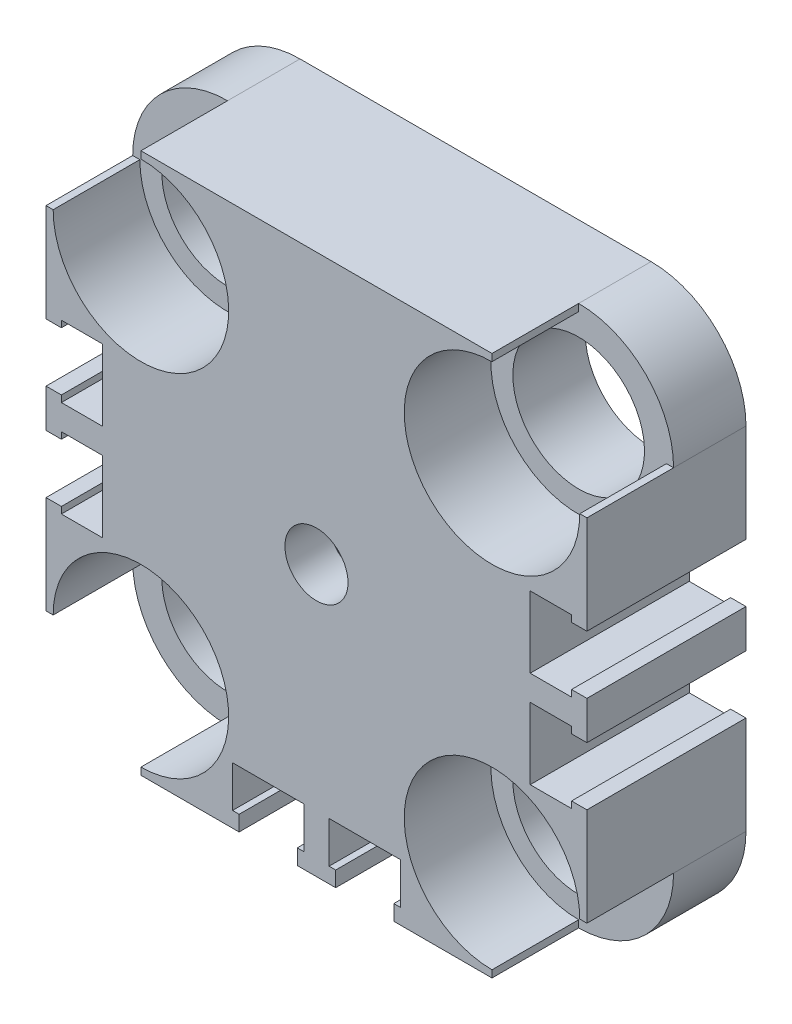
ISO-10303-21;
HEADER;
FILE_DESCRIPTION(('STEP AP214'),'2;1');
FILE_NAME('part.step','',(''),(''),'','','');
FILE_SCHEMA(('AUTOMOTIVE_DESIGN { 1 0 10303 214 1 1 1 1 }'));
ENDSEC;
DATA;
#1=APPLICATION_CONTEXT('core data for automotive mechanical design processes');
#2=APPLICATION_PROTOCOL_DEFINITION('international standard','automotive_design',2000,#1);
#3=PRODUCT_CONTEXT('',#1,'mechanical');
#4=PRODUCT('Part','Part','',(#3));
#5=PRODUCT_RELATED_PRODUCT_CATEGORY('part','',(#4));
#6=PRODUCT_DEFINITION_FORMATION('','',#4);
#7=PRODUCT_DEFINITION_CONTEXT('part definition',#1,'design');
#8=PRODUCT_DEFINITION('design','',#6,#7);
#9=PRODUCT_DEFINITION_SHAPE('','',#8);
#10=(LENGTH_UNIT() NAMED_UNIT(*) SI_UNIT(.MILLI.,.METRE.));
#11=(NAMED_UNIT(*) PLANE_ANGLE_UNIT() SI_UNIT($,.RADIAN.));
#12=(NAMED_UNIT(*) SI_UNIT($,.STERADIAN.) SOLID_ANGLE_UNIT());
#13=UNCERTAINTY_MEASURE_WITH_UNIT(LENGTH_MEASURE(1.E-05),#10,'distance_accuracy_value','');
#14=(GEOMETRIC_REPRESENTATION_CONTEXT(3) GLOBAL_UNCERTAINTY_ASSIGNED_CONTEXT((#13)) GLOBAL_UNIT_ASSIGNED_CONTEXT((#10,
#11,#12)) REPRESENTATION_CONTEXT('',''));
#15=CARTESIAN_POINT('',(0.,0.,0.));
#16=DIRECTION('',(0.,0.,1.));
#17=DIRECTION('',(1.,0.,0.));
#18=AXIS2_PLACEMENT_3D('',#15,#16,#17);
#19=CARTESIAN_POINT('',(16.,16.,-14.5));
#20=DIRECTION('',(0.,0.,-1.));
#21=DIRECTION('',(-1.,0.,0.));
#22=AXIS2_PLACEMENT_3D('',#19,#20,#21);
#23=PLANE('',#22);
#24=CARTESIAN_POINT('',(-16.,16.,-14.5));
#25=DIRECTION('',(0.,0.,-1.));
#26=DIRECTION('',(-1.,0.,0.));
#27=AXIS2_PLACEMENT_3D('',#24,#25,#26);
#28=CIRCLE('',#27,6.);
#29=CARTESIAN_POINT('',(-22.,16.,-14.5));
#30=VERTEX_POINT('',#29);
#31=EDGE_CURVE('E628',#30,#30,#28,.T.);
#32=ORIENTED_EDGE('',*,*,#31,.F.);
#33=EDGE_LOOP('',(#32));
#34=FACE_BOUND('',#33,.T.);
#35=CARTESIAN_POINT('',(-16.,-16.,-14.5));
#36=DIRECTION('',(0.,0.,-1.));
#37=DIRECTION('',(-1.,0.,0.));
#38=AXIS2_PLACEMENT_3D('',#35,#36,#37);
#39=CIRCLE('',#38,6.);
#40=CARTESIAN_POINT('',(-22.,-16.,-14.5));
#41=VERTEX_POINT('',#40);
#42=EDGE_CURVE('E702',#41,#41,#39,.T.);
#43=ORIENTED_EDGE('',*,*,#42,.F.);
#44=EDGE_LOOP('',(#43));
#45=FACE_BOUND('',#44,.T.);
#46=CARTESIAN_POINT('',(16.0000000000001,-15.9999999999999,-14.5));
#47=DIRECTION('',(0.,0.,-1.));
#48=DIRECTION('',(-1.,0.,0.));
#49=AXIS2_PLACEMENT_3D('',#46,#47,#48);
#50=CIRCLE('',#49,6.);
#51=CARTESIAN_POINT('',(10.0000000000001,-15.9999999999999,-14.5));
#52=VERTEX_POINT('',#51);
#53=EDGE_CURVE('E696',#52,#52,#50,.T.);
#54=ORIENTED_EDGE('',*,*,#53,.F.);
#55=EDGE_LOOP('',(#54));
#56=FACE_BOUND('',#55,.T.);
#57=CARTESIAN_POINT('',(15.9999999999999,16.0000000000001,-14.5));
#58=DIRECTION('',(0.,0.,-1.));
#59=DIRECTION('',(-1.,0.,0.));
#60=AXIS2_PLACEMENT_3D('',#57,#58,#59);
#61=CIRCLE('',#60,6.);
#62=CARTESIAN_POINT('',(9.99999999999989,16.0000000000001,-14.5));
#63=VERTEX_POINT('',#62);
#64=EDGE_CURVE('E690',#63,#63,#61,.T.);
#65=ORIENTED_EDGE('',*,*,#64,.F.);
#66=EDGE_LOOP('',(#65));
#67=FACE_BOUND('',#66,.T.);
#68=DIRECTION('',(0.,-1.,0.));
#69=VECTOR('',#68,1.);
#70=CARTESIAN_POINT('',(23.25,1.15000000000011,-14.5));
#71=LINE('',#70,#69);
#72=CARTESIAN_POINT('',(23.25,1.75000000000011,-14.5));
#73=VERTEX_POINT('',#72);
#74=CARTESIAN_POINT('',(23.25,1.15000000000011,-14.5));
#75=VERTEX_POINT('',#74);
#76=EDGE_CURVE('E1859',#73,#75,#71,.T.);
#77=ORIENTED_EDGE('',*,*,#76,.F.);
#78=DIRECTION('',(-1.,0.,0.));
#79=VECTOR('',#78,1.);
#80=CARTESIAN_POINT('',(23.25,1.75000000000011,-14.5));
#81=LINE('',#80,#79);
#82=CARTESIAN_POINT('',(24.65,1.75000000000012,-14.5));
#83=VERTEX_POINT('',#82);
#84=EDGE_CURVE('E467',#83,#73,#81,.T.);
#85=ORIENTED_EDGE('',*,*,#84,.F.);
#86=DIRECTION('',(0.,1.,0.));
#87=VECTOR('',#86,1.);
#88=CARTESIAN_POINT('',(24.65,16.,-14.5));
#89=LINE('',#88,#87);
#90=CARTESIAN_POINT('',(24.65,-1.74999999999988,-14.5));
#91=VERTEX_POINT('',#90);
#92=EDGE_CURVE('E528',#91,#83,#89,.T.);
#93=ORIENTED_EDGE('',*,*,#92,.F.);
#94=DIRECTION('',(-1.,0.,0.));
#95=VECTOR('',#94,1.);
#96=CARTESIAN_POINT('',(23.25,-1.74999999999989,-14.5));
#97=LINE('',#96,#95);
#98=CARTESIAN_POINT('',(23.25,-1.74999999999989,-14.5));
#99=VERTEX_POINT('',#98);
#100=EDGE_CURVE('E1809',#91,#99,#97,.T.);
#101=ORIENTED_EDGE('',*,*,#100,.T.);
#102=DIRECTION('',(0.,1.,0.));
#103=VECTOR('',#102,1.);
#104=CARTESIAN_POINT('',(23.25,-1.14999999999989,-14.5));
#105=LINE('',#104,#103);
#106=CARTESIAN_POINT('',(23.25,-1.14999999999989,-14.5));
#107=VERTEX_POINT('',#106);
#108=EDGE_CURVE('E1812',#99,#107,#105,.T.);
#109=ORIENTED_EDGE('',*,*,#108,.T.);
#110=DIRECTION('',(-1.,0.,0.));
#111=VECTOR('',#110,1.);
#112=CARTESIAN_POINT('',(19.48,-1.14999999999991,-14.5));
#113=LINE('',#112,#111);
#114=CARTESIAN_POINT('',(19.48,-1.14999999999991,-14.5));
#115=VERTEX_POINT('',#114);
#116=EDGE_CURVE('E1815',#107,#115,#113,.T.);
#117=ORIENTED_EDGE('',*,*,#116,.T.);
#118=DIRECTION('',(0.,-1.,0.));
#119=VECTOR('',#118,1.);
#120=CARTESIAN_POINT('',(19.48,-7.64999999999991,-14.5));
#121=LINE('',#120,#119);
#122=CARTESIAN_POINT('',(19.48,-7.64999999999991,-14.5));
#123=VERTEX_POINT('',#122);
#124=EDGE_CURVE('E1818',#115,#123,#121,.T.);
#125=ORIENTED_EDGE('',*,*,#124,.T.);
#126=DIRECTION('',(1.,0.,0.));
#127=VECTOR('',#126,1.);
#128=CARTESIAN_POINT('',(23.25,-7.64999999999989,-14.5));
#129=LINE('',#128,#127);
#130=CARTESIAN_POINT('',(23.25,-7.64999999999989,-14.5));
#131=VERTEX_POINT('',#130);
#132=EDGE_CURVE('E1821',#123,#131,#129,.T.);
#133=ORIENTED_EDGE('',*,*,#132,.T.);
#134=DIRECTION('',(0.,1.,0.));
#135=VECTOR('',#134,1.);
#136=CARTESIAN_POINT('',(23.25,-7.04999999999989,-14.5));
#137=LINE('',#136,#135);
#138=CARTESIAN_POINT('',(23.25,-7.04999999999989,-14.5));
#139=VERTEX_POINT('',#138);
#140=EDGE_CURVE('E1823',#131,#139,#137,.T.);
#141=ORIENTED_EDGE('',*,*,#140,.T.);
#142=DIRECTION('',(1.,0.,0.));
#143=VECTOR('',#142,1.);
#144=CARTESIAN_POINT('',(24.65,-7.04999999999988,-14.5));
#145=LINE('',#144,#143);
#146=CARTESIAN_POINT('',(24.65,-7.04999999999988,-14.5));
#147=VERTEX_POINT('',#146);
#148=EDGE_CURVE('E1708',#139,#147,#145,.T.);
#149=ORIENTED_EDGE('',*,*,#148,.T.);
#150=CARTESIAN_POINT('',(24.65,-16.,-14.5));
#151=VERTEX_POINT('',#150);
#152=EDGE_CURVE('E526',#151,#147,#89,.T.);
#153=ORIENTED_EDGE('',*,*,#152,.F.);
#154=CARTESIAN_POINT('',(16.,-16.,-14.5));
#155=DIRECTION('',(0.,0.,1.));
#156=DIRECTION('',(1.,0.,0.));
#157=AXIS2_PLACEMENT_3D('',#154,#155,#156);
#158=CIRCLE('',#157,8.65);
#159=CARTESIAN_POINT('',(16.,-24.65,-14.5));
#160=VERTEX_POINT('',#159);
#161=EDGE_CURVE('E521',#160,#151,#158,.T.);
#162=ORIENTED_EDGE('',*,*,#161,.F.);
#163=DIRECTION('',(1.,0.,0.));
#164=VECTOR('',#163,1.);
#165=CARTESIAN_POINT('',(-16.,-24.65,-14.5));
#166=LINE('',#165,#164);
#167=CARTESIAN_POINT('',(7.05000000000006,-24.65,-14.5));
#168=VERTEX_POINT('',#167);
#169=EDGE_CURVE('E517',#168,#160,#166,.T.);
#170=ORIENTED_EDGE('',*,*,#169,.F.);
#171=DIRECTION('',(0.,-1.,0.));
#172=VECTOR('',#171,1.);
#173=CARTESIAN_POINT('',(7.05000000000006,-24.65,-14.5));
#174=LINE('',#173,#172);
#175=CARTESIAN_POINT('',(7.05000000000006,-23.25,-14.5));
#176=VERTEX_POINT('',#175);
#177=EDGE_CURVE('E56',#176,#168,#174,.T.);
#178=ORIENTED_EDGE('',*,*,#177,.F.);
#179=DIRECTION('',(-1.,0.,0.));
#180=VECTOR('',#179,1.);
#181=CARTESIAN_POINT('',(7.05000000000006,-23.25,-14.5));
#182=LINE('',#181,#180);
#183=CARTESIAN_POINT('',(7.65000000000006,-23.25,-14.5));
#184=VERTEX_POINT('',#183);
#185=EDGE_CURVE('E1896',#184,#176,#182,.T.);
#186=ORIENTED_EDGE('',*,*,#185,.F.);
#187=DIRECTION('',(0.,-1.,0.));
#188=VECTOR('',#187,1.);
#189=CARTESIAN_POINT('',(7.65000000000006,-23.25,-14.5));
#190=LINE('',#189,#188);
#191=CARTESIAN_POINT('',(7.65000000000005,-19.48,-14.5));
#192=VERTEX_POINT('',#191);
#193=EDGE_CURVE('E1898',#192,#184,#190,.T.);
#194=ORIENTED_EDGE('',*,*,#193,.F.);
#195=DIRECTION('',(1.,0.,0.));
#196=VECTOR('',#195,1.);
#197=CARTESIAN_POINT('',(7.65000000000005,-19.48,-14.5));
#198=LINE('',#197,#196);
#199=CARTESIAN_POINT('',(1.15000000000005,-19.48,-14.5));
#200=VERTEX_POINT('',#199);
#201=EDGE_CURVE('E1900',#200,#192,#198,.T.);
#202=ORIENTED_EDGE('',*,*,#201,.F.);
#203=DIRECTION('',(0.,1.,0.));
#204=VECTOR('',#203,1.);
#205=CARTESIAN_POINT('',(1.15000000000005,-19.48,-14.5));
#206=LINE('',#205,#204);
#207=CARTESIAN_POINT('',(1.15000000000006,-23.25,-14.5));
#208=VERTEX_POINT('',#207);
#209=EDGE_CURVE('E1902',#208,#200,#206,.T.);
#210=ORIENTED_EDGE('',*,*,#209,.F.);
#211=DIRECTION('',(-1.,0.,0.));
#212=VECTOR('',#211,1.);
#213=CARTESIAN_POINT('',(1.15000000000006,-23.25,-14.5));
#214=LINE('',#213,#212);
#215=CARTESIAN_POINT('',(1.75000000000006,-23.25,-14.5));
#216=VERTEX_POINT('',#215);
#217=EDGE_CURVE('E1903',#216,#208,#214,.T.);
#218=ORIENTED_EDGE('',*,*,#217,.F.);
#219=DIRECTION('',(0.,1.,0.));
#220=VECTOR('',#219,1.);
#221=CARTESIAN_POINT('',(1.75000000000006,-23.25,-14.5));
#222=LINE('',#221,#220);
#223=CARTESIAN_POINT('',(1.75000000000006,-24.65,-14.5));
#224=VERTEX_POINT('',#223);
#225=EDGE_CURVE('E1779',#224,#216,#222,.T.);
#226=ORIENTED_EDGE('',*,*,#225,.F.);
#227=CARTESIAN_POINT('',(-1.74999999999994,-24.65,-14.5));
#228=VERTEX_POINT('',#227);
#229=EDGE_CURVE('E522',#228,#224,#166,.T.);
#230=ORIENTED_EDGE('',*,*,#229,.F.);
#231=DIRECTION('',(0.,1.,0.));
#232=VECTOR('',#231,1.);
#233=CARTESIAN_POINT('',(-1.74999999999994,-23.25,-14.5));
#234=LINE('',#233,#232);
#235=CARTESIAN_POINT('',(-1.74999999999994,-23.25,-14.5));
#236=VERTEX_POINT('',#235);
#237=EDGE_CURVE('E1738',#228,#236,#234,.T.);
#238=ORIENTED_EDGE('',*,*,#237,.T.);
#239=DIRECTION('',(1.,0.,0.));
#240=VECTOR('',#239,1.);
#241=CARTESIAN_POINT('',(-1.14999999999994,-23.25,-14.5));
#242=LINE('',#241,#240);
#243=CARTESIAN_POINT('',(-1.14999999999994,-23.25,-14.5));
#244=VERTEX_POINT('',#243);
#245=EDGE_CURVE('E1741',#236,#244,#242,.T.);
#246=ORIENTED_EDGE('',*,*,#245,.T.);
#247=DIRECTION('',(0.,1.,0.));
#248=VECTOR('',#247,1.);
#249=CARTESIAN_POINT('',(-1.14999999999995,-19.48,-14.5));
#250=LINE('',#249,#248);
#251=CARTESIAN_POINT('',(-1.14999999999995,-19.48,-14.5));
#252=VERTEX_POINT('',#251);
#253=EDGE_CURVE('E1744',#244,#252,#250,.T.);
#254=ORIENTED_EDGE('',*,*,#253,.T.);
#255=DIRECTION('',(-1.,0.,0.));
#256=VECTOR('',#255,1.);
#257=CARTESIAN_POINT('',(-7.64999999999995,-19.48,-14.5));
#258=LINE('',#257,#256);
#259=CARTESIAN_POINT('',(-7.64999999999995,-19.48,-14.5));
#260=VERTEX_POINT('',#259);
#261=EDGE_CURVE('E1747',#252,#260,#258,.T.);
#262=ORIENTED_EDGE('',*,*,#261,.T.);
#263=DIRECTION('',(0.,-1.,0.));
#264=VECTOR('',#263,1.);
#265=CARTESIAN_POINT('',(-7.64999999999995,-23.25,-14.5));
#266=LINE('',#265,#264);
#267=CARTESIAN_POINT('',(-7.64999999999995,-23.25,-14.5));
#268=VERTEX_POINT('',#267);
#269=EDGE_CURVE('E795',#260,#268,#266,.T.);
#270=ORIENTED_EDGE('',*,*,#269,.T.);
#271=DIRECTION('',(1.,0.,0.));
#272=VECTOR('',#271,1.);
#273=CARTESIAN_POINT('',(-7.04999999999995,-23.25,-14.5));
#274=LINE('',#273,#272);
#275=CARTESIAN_POINT('',(-7.04999999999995,-23.25,-14.5));
#276=VERTEX_POINT('',#275);
#277=EDGE_CURVE('E789',#268,#276,#274,.T.);
#278=ORIENTED_EDGE('',*,*,#277,.T.);
#279=DIRECTION('',(0.,-1.,0.));
#280=VECTOR('',#279,1.);
#281=CARTESIAN_POINT('',(-7.04999999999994,-24.65,-14.5));
#282=LINE('',#281,#280);
#283=CARTESIAN_POINT('',(-7.04999999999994,-24.65,-14.5));
#284=VERTEX_POINT('',#283);
#285=EDGE_CURVE('E786',#276,#284,#282,.T.);
#286=ORIENTED_EDGE('',*,*,#285,.T.);
#287=CARTESIAN_POINT('',(-16.,-24.65,-14.5));
#288=VERTEX_POINT('',#287);
#289=EDGE_CURVE('E518',#288,#284,#166,.T.);
#290=ORIENTED_EDGE('',*,*,#289,.F.);
#291=CARTESIAN_POINT('',(-16.,-16.,-14.5));
#292=DIRECTION('',(0.,0.,1.));
#293=DIRECTION('',(1.,0.,0.));
#294=AXIS2_PLACEMENT_3D('',#291,#292,#293);
#295=CIRCLE('',#294,8.65);
#296=CARTESIAN_POINT('',(-24.65,-16.,-14.5));
#297=VERTEX_POINT('',#296);
#298=EDGE_CURVE('E513',#297,#288,#295,.T.);
#299=ORIENTED_EDGE('',*,*,#298,.F.);
#300=DIRECTION('',(0.,-1.,0.));
#301=VECTOR('',#300,1.);
#302=CARTESIAN_POINT('',(-24.65,16.,-14.5));
#303=LINE('',#302,#301);
#304=CARTESIAN_POINT('',(-24.65,-7.05,-14.5));
#305=VERTEX_POINT('',#304);
#306=EDGE_CURVE('E509',#305,#297,#303,.T.);
#307=ORIENTED_EDGE('',*,*,#306,.F.);
#308=DIRECTION('',(-1.,0.,0.));
#309=VECTOR('',#308,1.);
#310=CARTESIAN_POINT('',(-24.65,-7.05,-14.5));
#311=LINE('',#310,#309);
#312=CARTESIAN_POINT('',(-23.25,-7.05,-14.5));
#313=VERTEX_POINT('',#312);
#314=EDGE_CURVE('E830',#313,#305,#311,.T.);
#315=ORIENTED_EDGE('',*,*,#314,.F.);
#316=DIRECTION('',(0.,1.,0.));
#317=VECTOR('',#316,1.);
#318=CARTESIAN_POINT('',(-23.25,-7.05,-14.5));
#319=LINE('',#318,#317);
#320=CARTESIAN_POINT('',(-23.25,-7.65,-14.5));
#321=VERTEX_POINT('',#320);
#322=EDGE_CURVE('E832',#321,#313,#319,.T.);
#323=ORIENTED_EDGE('',*,*,#322,.F.);
#324=DIRECTION('',(-1.,0.,0.));
#325=VECTOR('',#324,1.);
#326=CARTESIAN_POINT('',(-23.25,-7.65,-14.5));
#327=LINE('',#326,#325);
#328=CARTESIAN_POINT('',(-19.48,-7.65,-14.5));
#329=VERTEX_POINT('',#328);
#330=EDGE_CURVE('E834',#329,#321,#327,.T.);
#331=ORIENTED_EDGE('',*,*,#330,.F.);
#332=DIRECTION('',(0.,-1.,0.));
#333=VECTOR('',#332,1.);
#334=CARTESIAN_POINT('',(-19.48,-7.65,-14.5));
#335=LINE('',#334,#333);
#336=CARTESIAN_POINT('',(-19.48,-1.15,-14.5));
#337=VERTEX_POINT('',#336);
#338=EDGE_CURVE('E836',#337,#329,#335,.T.);
#339=ORIENTED_EDGE('',*,*,#338,.F.);
#340=DIRECTION('',(1.,0.,0.));
#341=VECTOR('',#340,1.);
#342=CARTESIAN_POINT('',(-19.48,-1.15,-14.5));
#343=LINE('',#342,#341);
#344=CARTESIAN_POINT('',(-23.25,-1.15,-14.5));
#345=VERTEX_POINT('',#344);
#346=EDGE_CURVE('E838',#345,#337,#343,.T.);
#347=ORIENTED_EDGE('',*,*,#346,.F.);
#348=DIRECTION('',(0.,1.,0.));
#349=VECTOR('',#348,1.);
#350=CARTESIAN_POINT('',(-23.25,-1.15,-14.5));
#351=LINE('',#350,#349);
#352=CARTESIAN_POINT('',(-23.25,-1.75,-14.5));
#353=VERTEX_POINT('',#352);
#354=EDGE_CURVE('E840',#353,#345,#351,.T.);
#355=ORIENTED_EDGE('',*,*,#354,.F.);
#356=DIRECTION('',(1.,0.,0.));
#357=VECTOR('',#356,1.);
#358=CARTESIAN_POINT('',(-23.25,-1.75,-14.5));
#359=LINE('',#358,#357);
#360=CARTESIAN_POINT('',(-24.65,-1.75,-14.5));
#361=VERTEX_POINT('',#360);
#362=EDGE_CURVE('E842',#361,#353,#359,.T.);
#363=ORIENTED_EDGE('',*,*,#362,.F.);
#364=CARTESIAN_POINT('',(-24.65,1.75,-14.5));
#365=VERTEX_POINT('',#364);
#366=EDGE_CURVE('E514',#365,#361,#303,.T.);
#367=ORIENTED_EDGE('',*,*,#366,.F.);
#368=DIRECTION('',(1.,0.,0.));
#369=VECTOR('',#368,1.);
#370=CARTESIAN_POINT('',(-23.25,1.75,-14.5));
#371=LINE('',#370,#369);
#372=CARTESIAN_POINT('',(-23.25,1.75,-14.5));
#373=VERTEX_POINT('',#372);
#374=EDGE_CURVE('E881',#365,#373,#371,.T.);
#375=ORIENTED_EDGE('',*,*,#374,.T.);
#376=DIRECTION('',(0.,-1.,0.));
#377=VECTOR('',#376,1.);
#378=CARTESIAN_POINT('',(-23.25,1.15,-14.5));
#379=LINE('',#378,#377);
#380=CARTESIAN_POINT('',(-23.25,1.15,-14.5));
#381=VERTEX_POINT('',#380);
#382=EDGE_CURVE('E884',#373,#381,#379,.T.);
#383=ORIENTED_EDGE('',*,*,#382,.T.);
#384=DIRECTION('',(1.,0.,0.));
#385=VECTOR('',#384,1.);
#386=CARTESIAN_POINT('',(-19.48,1.15,-14.5));
#387=LINE('',#386,#385);
#388=CARTESIAN_POINT('',(-19.48,1.15,-14.5));
#389=VERTEX_POINT('',#388);
#390=EDGE_CURVE('E887',#381,#389,#387,.T.);
#391=ORIENTED_EDGE('',*,*,#390,.T.);
#392=DIRECTION('',(0.,1.,0.));
#393=VECTOR('',#392,1.);
#394=CARTESIAN_POINT('',(-19.48,7.65,-14.5));
#395=LINE('',#394,#393);
#396=CARTESIAN_POINT('',(-19.48,7.65,-14.5));
#397=VERTEX_POINT('',#396);
#398=EDGE_CURVE('E890',#389,#397,#395,.T.);
#399=ORIENTED_EDGE('',*,*,#398,.T.);
#400=DIRECTION('',(-1.,0.,0.));
#401=VECTOR('',#400,1.);
#402=CARTESIAN_POINT('',(-23.25,7.65,-14.5));
#403=LINE('',#402,#401);
#404=CARTESIAN_POINT('',(-23.25,7.65,-14.5));
#405=VERTEX_POINT('',#404);
#406=EDGE_CURVE('E893',#397,#405,#403,.T.);
#407=ORIENTED_EDGE('',*,*,#406,.T.);
#408=DIRECTION('',(0.,-1.,0.));
#409=VECTOR('',#408,1.);
#410=CARTESIAN_POINT('',(-23.25,7.05,-14.5));
#411=LINE('',#410,#409);
#412=CARTESIAN_POINT('',(-23.25,7.05,-14.5));
#413=VERTEX_POINT('',#412);
#414=EDGE_CURVE('E895',#405,#413,#411,.T.);
#415=ORIENTED_EDGE('',*,*,#414,.T.);
#416=DIRECTION('',(-1.,0.,0.));
#417=VECTOR('',#416,1.);
#418=CARTESIAN_POINT('',(-24.65,7.05,-14.5));
#419=LINE('',#418,#417);
#420=CARTESIAN_POINT('',(-24.65,7.05,-14.5));
#421=VERTEX_POINT('',#420);
#422=EDGE_CURVE('E671',#413,#421,#419,.T.);
#423=ORIENTED_EDGE('',*,*,#422,.T.);
#424=CARTESIAN_POINT('',(-24.65,16.,-14.5));
#425=VERTEX_POINT('',#424);
#426=EDGE_CURVE('E510',#425,#421,#303,.T.);
#427=ORIENTED_EDGE('',*,*,#426,.F.);
#428=CARTESIAN_POINT('',(-16.,16.,-14.5));
#429=DIRECTION('',(0.,0.,1.));
#430=DIRECTION('',(1.,0.,0.));
#431=AXIS2_PLACEMENT_3D('',#428,#429,#430);
#432=CIRCLE('',#431,8.65);
#433=CARTESIAN_POINT('',(-16.,24.65,-14.5));
#434=VERTEX_POINT('',#433);
#435=EDGE_CURVE('E504',#434,#425,#432,.T.);
#436=ORIENTED_EDGE('',*,*,#435,.F.);
#437=DIRECTION('',(-1.,0.,0.));
#438=VECTOR('',#437,1.);
#439=CARTESIAN_POINT('',(-16.,24.65,-14.5));
#440=LINE('',#439,#438);
#441=CARTESIAN_POINT('',(16.,24.65,-14.5));
#442=VERTEX_POINT('',#441);
#443=EDGE_CURVE('E498',#442,#434,#440,.T.);
#444=ORIENTED_EDGE('',*,*,#443,.F.);
#445=CARTESIAN_POINT('',(16.,16.,-14.5));
#446=DIRECTION('',(0.,0.,1.));
#447=DIRECTION('',(-1.,0.,0.));
#448=AXIS2_PLACEMENT_3D('',#445,#446,#447);
#449=CIRCLE('',#448,8.65);
#450=CARTESIAN_POINT('',(24.65,16.,-14.5));
#451=VERTEX_POINT('',#450);
#452=EDGE_CURVE('E493',#451,#442,#449,.T.);
#453=ORIENTED_EDGE('',*,*,#452,.F.);
#454=CARTESIAN_POINT('',(24.65,7.05000000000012,-14.5));
#455=VERTEX_POINT('',#454);
#456=EDGE_CURVE('E525',#455,#451,#89,.T.);
#457=ORIENTED_EDGE('',*,*,#456,.F.);
#458=DIRECTION('',(1.,0.,0.));
#459=VECTOR('',#458,1.);
#460=CARTESIAN_POINT('',(24.65,7.05000000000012,-14.5));
#461=LINE('',#460,#459);
#462=CARTESIAN_POINT('',(23.25,7.05000000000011,-14.5));
#463=VERTEX_POINT('',#462);
#464=EDGE_CURVE('E48',#463,#455,#461,.T.);
#465=ORIENTED_EDGE('',*,*,#464,.F.);
#466=DIRECTION('',(0.,-1.,0.));
#467=VECTOR('',#466,1.);
#468=CARTESIAN_POINT('',(23.25,7.05000000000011,-14.5));
#469=LINE('',#468,#467);
#470=CARTESIAN_POINT('',(23.25,7.65000000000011,-14.5));
#471=VERTEX_POINT('',#470);
#472=EDGE_CURVE('E1845',#471,#463,#469,.T.);
#473=ORIENTED_EDGE('',*,*,#472,.F.);
#474=DIRECTION('',(1.,0.,0.));
#475=VECTOR('',#474,1.);
#476=CARTESIAN_POINT('',(23.25,7.65000000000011,-14.5));
#477=LINE('',#476,#475);
#478=CARTESIAN_POINT('',(19.48,7.65000000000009,-14.5));
#479=VERTEX_POINT('',#478);
#480=EDGE_CURVE('E1848',#479,#471,#477,.T.);
#481=ORIENTED_EDGE('',*,*,#480,.F.);
#482=DIRECTION('',(0.,1.,0.));
#483=VECTOR('',#482,1.);
#484=CARTESIAN_POINT('',(19.48,7.65000000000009,-14.5));
#485=LINE('',#484,#483);
#486=CARTESIAN_POINT('',(19.48,1.15000000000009,-14.5));
#487=VERTEX_POINT('',#486);
#488=EDGE_CURVE('E1855',#487,#479,#485,.T.);
#489=ORIENTED_EDGE('',*,*,#488,.F.);
#490=DIRECTION('',(-1.,0.,0.));
#491=VECTOR('',#490,1.);
#492=CARTESIAN_POINT('',(19.48,1.15000000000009,-14.5));
#493=LINE('',#492,#491);
#494=EDGE_CURVE('E1857',#75,#487,#493,.T.);
#495=ORIENTED_EDGE('',*,*,#494,.F.);
#496=EDGE_LOOP('',(#77,#85,#93,#101,#109,#117,#125,#133,#141,#149,#153,#162,#170,#178,#186,#194,
#202,#210,#218,#226,#230,#238,#246,#254,#262,#270,#278,#286,#290,#299,#307,#315,#323,#331,#339,
#347,#355,#363,#367,#375,#383,#391,#399,#407,#415,#423,#427,#436,#444,#453,#457,#465,#473,#481,
#489,#495));
#497=FACE_BOUND('',#496,.T.);
#498=ADVANCED_FACE('F31',(#34,#45,#56,#67,#497),#23,.T.);
#499=CARTESIAN_POINT('',(16.,16.,0.));
#500=DIRECTION('',(0.,0.,-1.));
#501=DIRECTION('',(-1.,0.,0.));
#502=AXIS2_PLACEMENT_3D('',#499,#500,#501);
#503=PLANE('',#502);
#504=CARTESIAN_POINT('',(0.,0.,0.));
#505=DIRECTION('',(0.,0.,1.));
#506=DIRECTION('',(1.,0.,0.));
#507=AXIS2_PLACEMENT_3D('',#504,#505,#506);
#508=CIRCLE('',#507,2.875);
#509=CARTESIAN_POINT('',(2.875,0.,0.));
#510=VERTEX_POINT('',#509);
#511=EDGE_CURVE('E662',#510,#510,#508,.T.);
#512=ORIENTED_EDGE('',*,*,#511,.F.);
#513=EDGE_LOOP('',(#512));
#514=FACE_BOUND('',#513,.T.);
#515=DIRECTION('',(-1.,0.,0.));
#516=VECTOR('',#515,1.);
#517=CARTESIAN_POINT('',(23.25,1.75000000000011,0.));
#518=LINE('',#517,#516);
#519=CARTESIAN_POINT('',(24.65,1.75000000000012,0.));
#520=VERTEX_POINT('',#519);
#521=CARTESIAN_POINT('',(23.25,1.75000000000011,0.));
#522=VERTEX_POINT('',#521);
#523=EDGE_CURVE('E1846',#520,#522,#518,.T.);
#524=ORIENTED_EDGE('',*,*,#523,.T.);
#525=DIRECTION('',(0.,-1.,0.));
#526=VECTOR('',#525,1.);
#527=CARTESIAN_POINT('',(23.25,1.15000000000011,0.));
#528=LINE('',#527,#526);
#529=CARTESIAN_POINT('',(23.25,1.15000000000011,0.));
#530=VERTEX_POINT('',#529);
#531=EDGE_CURVE('E1850',#522,#530,#528,.T.);
#532=ORIENTED_EDGE('',*,*,#531,.T.);
#533=DIRECTION('',(-1.,0.,0.));
#534=VECTOR('',#533,1.);
#535=CARTESIAN_POINT('',(19.48,1.15000000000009,0.));
#536=LINE('',#535,#534);
#537=CARTESIAN_POINT('',(19.48,1.15000000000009,0.));
#538=VERTEX_POINT('',#537);
#539=EDGE_CURVE('E1942',#530,#538,#536,.T.);
#540=ORIENTED_EDGE('',*,*,#539,.T.);
#541=DIRECTION('',(0.,1.,0.));
#542=VECTOR('',#541,1.);
#543=CARTESIAN_POINT('',(19.48,7.65000000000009,0.));
#544=LINE('',#543,#542);
#545=CARTESIAN_POINT('',(19.48,7.65000000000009,0.));
#546=VERTEX_POINT('',#545);
#547=EDGE_CURVE('E1938',#538,#546,#544,.T.);
#548=ORIENTED_EDGE('',*,*,#547,.T.);
#549=DIRECTION('',(1.,0.,0.));
#550=VECTOR('',#549,1.);
#551=CARTESIAN_POINT('',(23.25,7.65000000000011,0.));
#552=LINE('',#551,#550);
#553=CARTESIAN_POINT('',(23.25,7.65000000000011,0.));
#554=VERTEX_POINT('',#553);
#555=EDGE_CURVE('E1932',#546,#554,#552,.T.);
#556=ORIENTED_EDGE('',*,*,#555,.T.);
#557=DIRECTION('',(0.,-1.,0.));
#558=VECTOR('',#557,1.);
#559=CARTESIAN_POINT('',(23.25,7.05000000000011,0.));
#560=LINE('',#559,#558);
#561=CARTESIAN_POINT('',(23.25,7.05000000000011,0.));
#562=VERTEX_POINT('',#561);
#563=EDGE_CURVE('E477',#554,#562,#560,.T.);
#564=ORIENTED_EDGE('',*,*,#563,.T.);
#565=DIRECTION('',(1.,0.,0.));
#566=VECTOR('',#565,1.);
#567=CARTESIAN_POINT('',(24.65,7.05000000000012,0.));
#568=LINE('',#567,#566);
#569=CARTESIAN_POINT('',(24.65,7.05000000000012,0.));
#570=VERTEX_POINT('',#569);
#571=EDGE_CURVE('E461',#562,#570,#568,.T.);
#572=ORIENTED_EDGE('',*,*,#571,.T.);
#573=DIRECTION('',(0.,1.,0.));
#574=VECTOR('',#573,1.);
#575=CARTESIAN_POINT('',(24.65,16.,0.));
#576=LINE('',#575,#574);
#577=CARTESIAN_POINT('',(24.6499999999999,16.0000000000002,0.));
#578=VERTEX_POINT('',#577);
#579=EDGE_CURVE('E473',#570,#578,#576,.T.);
#580=ORIENTED_EDGE('',*,*,#579,.T.);
#581=DIRECTION('',(1.,0.,0.));
#582=VECTOR('',#581,1.);
#583=CARTESIAN_POINT('',(23.9999999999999,16.0000000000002,0.));
#584=LINE('',#583,#582);
#585=CARTESIAN_POINT('',(23.9999999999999,16.0000000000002,0.));
#586=VERTEX_POINT('',#585);
#587=EDGE_CURVE('E711',#586,#578,#584,.T.);
#588=ORIENTED_EDGE('',*,*,#587,.F.);
#589=CARTESIAN_POINT('',(15.9999999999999,16.0000000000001,0.));
#590=DIRECTION('',(0.,0.,1.));
#591=DIRECTION('',(0.,-1.,0.));
#592=AXIS2_PLACEMENT_3D('',#589,#590,#591);
#593=CIRCLE('',#592,8.);
#594=CARTESIAN_POINT('',(15.9999999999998,24.0000000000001,0.));
#595=VERTEX_POINT('',#594);
#596=EDGE_CURVE('E708',#595,#586,#593,.T.);
#597=ORIENTED_EDGE('',*,*,#596,.F.);
#598=DIRECTION('',(0.,-1.,0.));
#599=VECTOR('',#598,1.);
#600=CARTESIAN_POINT('',(15.9999999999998,24.0000000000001,0.));
#601=LINE('',#600,#599);
#602=CARTESIAN_POINT('',(16.,24.65,0.));
#603=VERTEX_POINT('',#602);
#604=EDGE_CURVE('E705',#603,#595,#601,.T.);
#605=ORIENTED_EDGE('',*,*,#604,.F.);
#606=DIRECTION('',(-1.,0.,0.));
#607=VECTOR('',#606,1.);
#608=CARTESIAN_POINT('',(-16.,24.65,0.));
#609=LINE('',#608,#607);
#610=CARTESIAN_POINT('',(-16.,24.65,0.));
#611=VERTEX_POINT('',#610);
#612=EDGE_CURVE('E585',#603,#611,#609,.T.);
#613=ORIENTED_EDGE('',*,*,#612,.T.);
#614=DIRECTION('',(0.,1.,0.));
#615=VECTOR('',#614,1.);
#616=CARTESIAN_POINT('',(-16.,24.,0.));
#617=LINE('',#616,#615);
#618=CARTESIAN_POINT('',(-16.,24.,0.));
#619=VERTEX_POINT('',#618);
#620=EDGE_CURVE('E570',#619,#611,#617,.T.);
#621=ORIENTED_EDGE('',*,*,#620,.F.);
#622=CARTESIAN_POINT('',(-16.,16.,0.));
#623=DIRECTION('',(0.,0.,1.));
#624=DIRECTION('',(1.,0.,0.));
#625=AXIS2_PLACEMENT_3D('',#622,#623,#624);
#626=CIRCLE('',#625,8.);
#627=CARTESIAN_POINT('',(-24.,16.,0.));
#628=VERTEX_POINT('',#627);
#629=EDGE_CURVE('E574',#628,#619,#626,.T.);
#630=ORIENTED_EDGE('',*,*,#629,.F.);
#631=DIRECTION('',(1.,0.,0.));
#632=VECTOR('',#631,1.);
#633=CARTESIAN_POINT('',(-24.,16.,0.));
#634=LINE('',#633,#632);
#635=CARTESIAN_POINT('',(-24.65,16.,0.));
#636=VERTEX_POINT('',#635);
#637=EDGE_CURVE('E641',#636,#628,#634,.T.);
#638=ORIENTED_EDGE('',*,*,#637,.F.);
#639=DIRECTION('',(0.,-1.,0.));
#640=VECTOR('',#639,1.);
#641=CARTESIAN_POINT('',(-24.65,16.,0.));
#642=LINE('',#641,#640);
#643=CARTESIAN_POINT('',(-24.65,7.05,0.));
#644=VERTEX_POINT('',#643);
#645=EDGE_CURVE('E594',#636,#644,#642,.T.);
#646=ORIENTED_EDGE('',*,*,#645,.T.);
#647=DIRECTION('',(-1.,0.,0.));
#648=VECTOR('',#647,1.);
#649=CARTESIAN_POINT('',(-24.65,7.05,0.));
#650=LINE('',#649,#648);
#651=CARTESIAN_POINT('',(-23.25,7.05,0.));
#652=VERTEX_POINT('',#651);
#653=EDGE_CURVE('E879',#652,#644,#650,.T.);
#654=ORIENTED_EDGE('',*,*,#653,.F.);
#655=DIRECTION('',(0.,-1.,0.));
#656=VECTOR('',#655,1.);
#657=CARTESIAN_POINT('',(-23.25,7.05,0.));
#658=LINE('',#657,#656);
#659=CARTESIAN_POINT('',(-23.25,7.65,0.));
#660=VERTEX_POINT('',#659);
#661=EDGE_CURVE('E876',#660,#652,#658,.T.);
#662=ORIENTED_EDGE('',*,*,#661,.F.);
#663=DIRECTION('',(-1.,0.,0.));
#664=VECTOR('',#663,1.);
#665=CARTESIAN_POINT('',(-23.25,7.65,0.));
#666=LINE('',#665,#664);
#667=CARTESIAN_POINT('',(-19.48,7.65,0.));
#668=VERTEX_POINT('',#667);
#669=EDGE_CURVE('E873',#668,#660,#666,.T.);
#670=ORIENTED_EDGE('',*,*,#669,.F.);
#671=DIRECTION('',(0.,1.,0.));
#672=VECTOR('',#671,1.);
#673=CARTESIAN_POINT('',(-19.48,7.65,0.));
#674=LINE('',#673,#672);
#675=CARTESIAN_POINT('',(-19.48,1.15,0.));
#676=VERTEX_POINT('',#675);
#677=EDGE_CURVE('E870',#676,#668,#674,.T.);
#678=ORIENTED_EDGE('',*,*,#677,.F.);
#679=DIRECTION('',(1.,0.,0.));
#680=VECTOR('',#679,1.);
#681=CARTESIAN_POINT('',(-19.48,1.15,0.));
#682=LINE('',#681,#680);
#683=CARTESIAN_POINT('',(-23.25,1.15,0.));
#684=VERTEX_POINT('',#683);
#685=EDGE_CURVE('E867',#684,#676,#682,.T.);
#686=ORIENTED_EDGE('',*,*,#685,.F.);
#687=DIRECTION('',(0.,-1.,0.));
#688=VECTOR('',#687,1.);
#689=CARTESIAN_POINT('',(-23.25,1.15,0.));
#690=LINE('',#689,#688);
#691=CARTESIAN_POINT('',(-23.25,1.75,0.));
#692=VERTEX_POINT('',#691);
#693=EDGE_CURVE('E864',#692,#684,#690,.T.);
#694=ORIENTED_EDGE('',*,*,#693,.F.);
#695=DIRECTION('',(1.,0.,0.));
#696=VECTOR('',#695,1.);
#697=CARTESIAN_POINT('',(-23.25,1.75,0.));
#698=LINE('',#697,#696);
#699=CARTESIAN_POINT('',(-24.65,1.75,0.));
#700=VERTEX_POINT('',#699);
#701=EDGE_CURVE('E848',#700,#692,#698,.T.);
#702=ORIENTED_EDGE('',*,*,#701,.F.);
#703=CARTESIAN_POINT('',(-24.65,-1.75,0.));
#704=VERTEX_POINT('',#703);
#705=EDGE_CURVE('E596',#700,#704,#642,.T.);
#706=ORIENTED_EDGE('',*,*,#705,.T.);
#707=DIRECTION('',(1.,0.,0.));
#708=VECTOR('',#707,1.);
#709=CARTESIAN_POINT('',(-23.25,-1.75,0.));
#710=LINE('',#709,#708);
#711=CARTESIAN_POINT('',(-23.25,-1.75,0.));
#712=VERTEX_POINT('',#711);
#713=EDGE_CURVE('E827',#704,#712,#710,.T.);
#714=ORIENTED_EDGE('',*,*,#713,.T.);
#715=DIRECTION('',(0.,1.,0.));
#716=VECTOR('',#715,1.);
#717=CARTESIAN_POINT('',(-23.25,-1.15,0.));
#718=LINE('',#717,#716);
#719=CARTESIAN_POINT('',(-23.25,-1.15,0.));
#720=VERTEX_POINT('',#719);
#721=EDGE_CURVE('E824',#712,#720,#718,.T.);
#722=ORIENTED_EDGE('',*,*,#721,.T.);
#723=DIRECTION('',(1.,0.,0.));
#724=VECTOR('',#723,1.);
#725=CARTESIAN_POINT('',(-19.48,-1.15,0.));
#726=LINE('',#725,#724);
#727=CARTESIAN_POINT('',(-19.48,-1.15,0.));
#728=VERTEX_POINT('',#727);
#729=EDGE_CURVE('E821',#720,#728,#726,.T.);
#730=ORIENTED_EDGE('',*,*,#729,.T.);
#731=DIRECTION('',(0.,-1.,0.));
#732=VECTOR('',#731,1.);
#733=CARTESIAN_POINT('',(-19.48,-7.65,0.));
#734=LINE('',#733,#732);
#735=CARTESIAN_POINT('',(-19.48,-7.65,0.));
#736=VERTEX_POINT('',#735);
#737=EDGE_CURVE('E818',#728,#736,#734,.T.);
#738=ORIENTED_EDGE('',*,*,#737,.T.);
#739=DIRECTION('',(-1.,0.,0.));
#740=VECTOR('',#739,1.);
#741=CARTESIAN_POINT('',(-23.25,-7.65,0.));
#742=LINE('',#741,#740);
#743=CARTESIAN_POINT('',(-23.25,-7.65,0.));
#744=VERTEX_POINT('',#743);
#745=EDGE_CURVE('E815',#736,#744,#742,.T.);
#746=ORIENTED_EDGE('',*,*,#745,.T.);
#747=DIRECTION('',(0.,1.,0.));
#748=VECTOR('',#747,1.);
#749=CARTESIAN_POINT('',(-23.25,-7.05,0.));
#750=LINE('',#749,#748);
#751=CARTESIAN_POINT('',(-23.25,-7.05,0.));
#752=VERTEX_POINT('',#751);
#753=EDGE_CURVE('E813',#744,#752,#750,.T.);
#754=ORIENTED_EDGE('',*,*,#753,.T.);
#755=DIRECTION('',(-1.,0.,0.));
#756=VECTOR('',#755,1.);
#757=CARTESIAN_POINT('',(-24.65,-7.05,0.));
#758=LINE('',#757,#756);
#759=CARTESIAN_POINT('',(-24.65,-7.05,0.));
#760=VERTEX_POINT('',#759);
#761=EDGE_CURVE('E609',#752,#760,#758,.T.);
#762=ORIENTED_EDGE('',*,*,#761,.T.);
#763=CARTESIAN_POINT('',(-24.65,-16.0000000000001,0.));
#764=VERTEX_POINT('',#763);
#765=EDGE_CURVE('E593',#760,#764,#642,.T.);
#766=ORIENTED_EDGE('',*,*,#765,.T.);
#767=DIRECTION('',(-1.,0.,0.));
#768=VECTOR('',#767,1.);
#769=CARTESIAN_POINT('',(-24.,-16.0000000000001,0.));
#770=LINE('',#769,#768);
#771=CARTESIAN_POINT('',(-24.,-16.0000000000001,0.));
#772=VERTEX_POINT('',#771);
#773=EDGE_CURVE('E606',#772,#764,#770,.T.);
#774=ORIENTED_EDGE('',*,*,#773,.F.);
#775=CARTESIAN_POINT('',(-16.,-16.,0.));
#776=DIRECTION('',(0.,0.,1.));
#777=DIRECTION('',(0.,1.,0.));
#778=AXIS2_PLACEMENT_3D('',#775,#776,#777);
#779=CIRCLE('',#778,8.);
#780=CARTESIAN_POINT('',(-15.9999999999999,-24.,0.));
#781=VERTEX_POINT('',#780);
#782=EDGE_CURVE('E621',#781,#772,#779,.T.);
#783=ORIENTED_EDGE('',*,*,#782,.F.);
#784=DIRECTION('',(0.,1.,0.));
#785=VECTOR('',#784,1.);
#786=CARTESIAN_POINT('',(-15.9999999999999,-24.,0.));
#787=LINE('',#786,#785);
#788=CARTESIAN_POINT('',(-16.,-24.65,0.));
#789=VERTEX_POINT('',#788);
#790=EDGE_CURVE('E754',#789,#781,#787,.T.);
#791=ORIENTED_EDGE('',*,*,#790,.F.);
#792=DIRECTION('',(1.,0.,0.));
#793=VECTOR('',#792,1.);
#794=CARTESIAN_POINT('',(-16.,-24.65,0.));
#795=LINE('',#794,#793);
#796=CARTESIAN_POINT('',(-7.04999999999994,-24.65,0.));
#797=VERTEX_POINT('',#796);
#798=EDGE_CURVE('E483',#789,#797,#795,.T.);
#799=ORIENTED_EDGE('',*,*,#798,.T.);
#800=DIRECTION('',(0.,-1.,0.));
#801=VECTOR('',#800,1.);
#802=CARTESIAN_POINT('',(-7.04999999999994,-24.65,0.));
#803=LINE('',#802,#801);
#804=CARTESIAN_POINT('',(-7.04999999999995,-23.25,0.));
#805=VERTEX_POINT('',#804);
#806=EDGE_CURVE('E1736',#805,#797,#803,.T.);
#807=ORIENTED_EDGE('',*,*,#806,.F.);
#808=DIRECTION('',(1.,0.,0.));
#809=VECTOR('',#808,1.);
#810=CARTESIAN_POINT('',(-7.04999999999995,-23.25,0.));
#811=LINE('',#810,#809);
#812=CARTESIAN_POINT('',(-7.64999999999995,-23.25,0.));
#813=VERTEX_POINT('',#812);
#814=EDGE_CURVE('E1733',#813,#805,#811,.T.);
#815=ORIENTED_EDGE('',*,*,#814,.F.);
#816=DIRECTION('',(0.,-1.,0.));
#817=VECTOR('',#816,1.);
#818=CARTESIAN_POINT('',(-7.64999999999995,-23.25,0.));
#819=LINE('',#818,#817);
#820=CARTESIAN_POINT('',(-7.64999999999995,-19.48,0.));
#821=VERTEX_POINT('',#820);
#822=EDGE_CURVE('E1730',#821,#813,#819,.T.);
#823=ORIENTED_EDGE('',*,*,#822,.F.);
#824=DIRECTION('',(-1.,0.,0.));
#825=VECTOR('',#824,1.);
#826=CARTESIAN_POINT('',(-7.64999999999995,-19.48,0.));
#827=LINE('',#826,#825);
#828=CARTESIAN_POINT('',(-1.14999999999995,-19.48,0.));
#829=VERTEX_POINT('',#828);
#830=EDGE_CURVE('E1727',#829,#821,#827,.T.);
#831=ORIENTED_EDGE('',*,*,#830,.F.);
#832=DIRECTION('',(0.,1.,0.));
#833=VECTOR('',#832,1.);
#834=CARTESIAN_POINT('',(-1.14999999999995,-19.48,0.));
#835=LINE('',#834,#833);
#836=CARTESIAN_POINT('',(-1.14999999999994,-23.25,0.));
#837=VERTEX_POINT('',#836);
#838=EDGE_CURVE('E1724',#837,#829,#835,.T.);
#839=ORIENTED_EDGE('',*,*,#838,.F.);
#840=DIRECTION('',(1.,0.,0.));
#841=VECTOR('',#840,1.);
#842=CARTESIAN_POINT('',(-1.14999999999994,-23.25,0.));
#843=LINE('',#842,#841);
#844=CARTESIAN_POINT('',(-1.74999999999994,-23.25,0.));
#845=VERTEX_POINT('',#844);
#846=EDGE_CURVE('E1703',#845,#837,#843,.T.);
#847=ORIENTED_EDGE('',*,*,#846,.F.);
#848=DIRECTION('',(0.,1.,0.));
#849=VECTOR('',#848,1.);
#850=CARTESIAN_POINT('',(-1.74999999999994,-23.25,0.));
#851=LINE('',#850,#849);
#852=CARTESIAN_POINT('',(-1.74999999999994,-24.65,0.));
#853=VERTEX_POINT('',#852);
#854=EDGE_CURVE('E1699',#853,#845,#851,.T.);
#855=ORIENTED_EDGE('',*,*,#854,.F.);
#856=CARTESIAN_POINT('',(1.75000000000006,-24.65,0.));
#857=VERTEX_POINT('',#856);
#858=EDGE_CURVE('E488',#853,#857,#795,.T.);
#859=ORIENTED_EDGE('',*,*,#858,.T.);
#860=DIRECTION('',(0.,1.,0.));
#861=VECTOR('',#860,1.);
#862=CARTESIAN_POINT('',(1.75000000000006,-23.25,0.));
#863=LINE('',#862,#861);
#864=CARTESIAN_POINT('',(1.75000000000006,-23.25,0.));
#865=VERTEX_POINT('',#864);
#866=EDGE_CURVE('E1893',#857,#865,#863,.T.);
#867=ORIENTED_EDGE('',*,*,#866,.T.);
#868=DIRECTION('',(-1.,0.,0.));
#869=VECTOR('',#868,1.);
#870=CARTESIAN_POINT('',(1.15000000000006,-23.25,0.));
#871=LINE('',#870,#869);
#872=CARTESIAN_POINT('',(1.15000000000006,-23.25,0.));
#873=VERTEX_POINT('',#872);
#874=EDGE_CURVE('E1890',#865,#873,#871,.T.);
#875=ORIENTED_EDGE('',*,*,#874,.T.);
#876=DIRECTION('',(0.,1.,0.));
#877=VECTOR('',#876,1.);
#878=CARTESIAN_POINT('',(1.15000000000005,-19.48,0.));
#879=LINE('',#878,#877);
#880=CARTESIAN_POINT('',(1.15000000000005,-19.48,0.));
#881=VERTEX_POINT('',#880);
#882=EDGE_CURVE('E1887',#873,#881,#879,.T.);
#883=ORIENTED_EDGE('',*,*,#882,.T.);
#884=DIRECTION('',(1.,0.,0.));
#885=VECTOR('',#884,1.);
#886=CARTESIAN_POINT('',(7.65000000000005,-19.48,0.));
#887=LINE('',#886,#885);
#888=CARTESIAN_POINT('',(7.65000000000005,-19.48,0.));
#889=VERTEX_POINT('',#888);
#890=EDGE_CURVE('E1884',#881,#889,#887,.T.);
#891=ORIENTED_EDGE('',*,*,#890,.T.);
#892=DIRECTION('',(0.,-1.,0.));
#893=VECTOR('',#892,1.);
#894=CARTESIAN_POINT('',(7.65000000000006,-23.25,0.));
#895=LINE('',#894,#893);
#896=CARTESIAN_POINT('',(7.65000000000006,-23.25,0.));
#897=VERTEX_POINT('',#896);
#898=EDGE_CURVE('E1881',#889,#897,#895,.T.);
#899=ORIENTED_EDGE('',*,*,#898,.T.);
#900=DIRECTION('',(-1.,0.,0.));
#901=VECTOR('',#900,1.);
#902=CARTESIAN_POINT('',(7.05000000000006,-23.25,0.));
#903=LINE('',#902,#901);
#904=CARTESIAN_POINT('',(7.05000000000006,-23.25,0.));
#905=VERTEX_POINT('',#904);
#906=EDGE_CURVE('E1878',#897,#905,#903,.T.);
#907=ORIENTED_EDGE('',*,*,#906,.T.);
#908=DIRECTION('',(0.,-1.,0.));
#909=VECTOR('',#908,1.);
#910=CARTESIAN_POINT('',(7.05000000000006,-24.65,0.));
#911=LINE('',#910,#909);
#912=CARTESIAN_POINT('',(7.05000000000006,-24.65,0.));
#913=VERTEX_POINT('',#912);
#914=EDGE_CURVE('E1864',#905,#913,#911,.T.);
#915=ORIENTED_EDGE('',*,*,#914,.T.);
#916=CARTESIAN_POINT('',(16.0000000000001,-24.6499999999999,0.));
#917=VERTEX_POINT('',#916);
#918=EDGE_CURVE('E490',#913,#917,#795,.T.);
#919=ORIENTED_EDGE('',*,*,#918,.T.);
#920=DIRECTION('',(0.,-1.,0.));
#921=VECTOR('',#920,1.);
#922=CARTESIAN_POINT('',(16.0000000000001,-23.9999999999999,0.));
#923=LINE('',#922,#921);
#924=CARTESIAN_POINT('',(16.0000000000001,-23.9999999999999,0.));
#925=VERTEX_POINT('',#924);
#926=EDGE_CURVE('E735',#925,#917,#923,.T.);
#927=ORIENTED_EDGE('',*,*,#926,.F.);
#928=CARTESIAN_POINT('',(16.0000000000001,-15.9999999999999,0.));
#929=DIRECTION('',(0.,0.,1.));
#930=DIRECTION('',(-1.,0.,0.));
#931=AXIS2_PLACEMENT_3D('',#928,#929,#930);
#932=CIRCLE('',#931,8.);
#933=CARTESIAN_POINT('',(24.0000000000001,-15.9999999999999,0.));
#934=VERTEX_POINT('',#933);
#935=EDGE_CURVE('E732',#934,#925,#932,.T.);
#936=ORIENTED_EDGE('',*,*,#935,.F.);
#937=DIRECTION('',(-1.,0.,0.));
#938=VECTOR('',#937,1.);
#939=CARTESIAN_POINT('',(24.0000000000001,-15.9999999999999,0.));
#940=LINE('',#939,#938);
#941=CARTESIAN_POINT('',(24.65,-16.,0.));
#942=VERTEX_POINT('',#941);
#943=EDGE_CURVE('E724',#942,#934,#940,.T.);
#944=ORIENTED_EDGE('',*,*,#943,.F.);
#945=CARTESIAN_POINT('',(24.65,-7.04999999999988,0.));
#946=VERTEX_POINT('',#945);
#947=EDGE_CURVE('E485',#942,#946,#576,.T.);
#948=ORIENTED_EDGE('',*,*,#947,.T.);
#949=DIRECTION('',(1.,0.,0.));
#950=VECTOR('',#949,1.);
#951=CARTESIAN_POINT('',(24.65,-7.04999999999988,0.));
#952=LINE('',#951,#950);
#953=CARTESIAN_POINT('',(23.25,-7.04999999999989,0.));
#954=VERTEX_POINT('',#953);
#955=EDGE_CURVE('E1807',#954,#946,#952,.T.);
#956=ORIENTED_EDGE('',*,*,#955,.F.);
#957=DIRECTION('',(0.,1.,0.));
#958=VECTOR('',#957,1.);
#959=CARTESIAN_POINT('',(23.25,-7.04999999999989,0.));
#960=LINE('',#959,#958);
#961=CARTESIAN_POINT('',(23.25,-7.64999999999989,0.));
#962=VERTEX_POINT('',#961);
#963=EDGE_CURVE('E1804',#962,#954,#960,.T.);
#964=ORIENTED_EDGE('',*,*,#963,.F.);
#965=DIRECTION('',(1.,0.,0.));
#966=VECTOR('',#965,1.);
#967=CARTESIAN_POINT('',(23.25,-7.64999999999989,0.));
#968=LINE('',#967,#966);
#969=CARTESIAN_POINT('',(19.48,-7.64999999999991,0.));
#970=VERTEX_POINT('',#969);
#971=EDGE_CURVE('E1801',#970,#962,#968,.T.);
#972=ORIENTED_EDGE('',*,*,#971,.F.);
#973=DIRECTION('',(0.,-1.,0.));
#974=VECTOR('',#973,1.);
#975=CARTESIAN_POINT('',(19.48,-7.64999999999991,0.));
#976=LINE('',#975,#974);
#977=CARTESIAN_POINT('',(19.48,-1.14999999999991,0.));
#978=VERTEX_POINT('',#977);
#979=EDGE_CURVE('E1798',#978,#970,#976,.T.);
#980=ORIENTED_EDGE('',*,*,#979,.F.);
#981=DIRECTION('',(-1.,0.,0.));
#982=VECTOR('',#981,1.);
#983=CARTESIAN_POINT('',(19.48,-1.14999999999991,0.));
#984=LINE('',#983,#982);
#985=CARTESIAN_POINT('',(23.25,-1.14999999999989,0.));
#986=VERTEX_POINT('',#985);
#987=EDGE_CURVE('E1795',#986,#978,#984,.T.);
#988=ORIENTED_EDGE('',*,*,#987,.F.);
#989=DIRECTION('',(0.,1.,0.));
#990=VECTOR('',#989,1.);
#991=CARTESIAN_POINT('',(23.25,-1.14999999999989,0.));
#992=LINE('',#991,#990);
#993=CARTESIAN_POINT('',(23.25,-1.74999999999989,0.));
#994=VERTEX_POINT('',#993);
#995=EDGE_CURVE('E1774',#994,#986,#992,.T.);
#996=ORIENTED_EDGE('',*,*,#995,.F.);
#997=DIRECTION('',(-1.,0.,0.));
#998=VECTOR('',#997,1.);
#999=CARTESIAN_POINT('',(23.25,-1.74999999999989,0.));
#1000=LINE('',#999,#998);
#1001=CARTESIAN_POINT('',(24.65,-1.74999999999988,0.));
#1002=VERTEX_POINT('',#1001);
#1003=EDGE_CURVE('E1770',#1002,#994,#1000,.T.);
#1004=ORIENTED_EDGE('',*,*,#1003,.F.);
#1005=EDGE_CURVE('E482',#1002,#520,#576,.T.);
#1006=ORIENTED_EDGE('',*,*,#1005,.T.);
#1007=EDGE_LOOP('',(#524,#532,#540,#548,#556,#564,#572,#580,#588,#597,#605,#613,#621,#630,#638,
#646,#654,#662,#670,#678,#686,#694,#702,#706,#714,#722,#730,#738,#746,#754,#762,#766,#774,#783,
#791,#799,#807,#815,#823,#831,#839,#847,#855,#859,#867,#875,#883,#891,#899,#907,#915,#919,#927,
#936,#944,#948,#956,#964,#972,#980,#988,#996,#1004,#1006));
#1008=FACE_BOUND('',#1007,.T.);
#1009=ADVANCED_FACE('F471',(#514,#1008),#503,.F.);
#1010=CARTESIAN_POINT('',(24.65,16.,-14.5));
#1011=DIRECTION('',(1.,0.,0.));
#1012=DIRECTION('',(0.,0.,-1.));
#1013=AXIS2_PLACEMENT_3D('',#1010,#1011,#1012);
#1014=PLANE('',#1013);
#1015=ORIENTED_EDGE('',*,*,#92,.T.);
#1016=DIRECTION('',(0.,0.,1.));
#1017=VECTOR('',#1016,1.);
#1018=CARTESIAN_POINT('',(24.65,1.75000000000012,-14.5));
#1019=LINE('',#1018,#1017);
#1020=EDGE_CURVE('E1862',#83,#520,#1019,.T.);
#1021=ORIENTED_EDGE('',*,*,#1020,.T.);
#1022=ORIENTED_EDGE('',*,*,#1005,.F.);
#1023=DIRECTION('',(0.,0.,1.));
#1024=VECTOR('',#1023,1.);
#1025=CARTESIAN_POINT('',(24.65,-1.74999999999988,-14.5));
#1026=LINE('',#1025,#1024);
#1027=EDGE_CURVE('E1720',#91,#1002,#1026,.T.);
#1028=ORIENTED_EDGE('',*,*,#1027,.F.);
#1029=EDGE_LOOP('',(#1015,#1021,#1022,#1028));
#1030=FACE_BOUND('',#1029,.T.);
#1031=ADVANCED_FACE('F974',(#1030),#1014,.T.);
#1032=ORIENTED_EDGE('',*,*,#579,.F.);
#1033=DIRECTION('',(0.,0.,1.));
#1034=VECTOR('',#1033,1.);
#1035=CARTESIAN_POINT('',(24.65,7.05000000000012,-14.5));
#1036=LINE('',#1035,#1034);
#1037=EDGE_CURVE('E458',#455,#570,#1036,.T.);
#1038=ORIENTED_EDGE('',*,*,#1037,.F.);
#1039=ORIENTED_EDGE('',*,*,#456,.T.);
#1040=DIRECTION('',(0.,0.,1.));
#1041=VECTOR('',#1040,1.);
#1042=CARTESIAN_POINT('',(24.65,16.,-14.5));
#1043=LINE('',#1042,#1041);
#1044=CARTESIAN_POINT('',(24.6499999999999,16.0000000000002,-7.9));
#1045=VERTEX_POINT('',#1044);
#1046=EDGE_CURVE('E11',#451,#1045,#1043,.T.);
#1047=ORIENTED_EDGE('',*,*,#1046,.T.);
#1048=DIRECTION('',(0.,0.,1.));
#1049=VECTOR('',#1048,1.);
#1050=CARTESIAN_POINT('',(24.6499999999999,16.0000000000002,-7.9));
#1051=LINE('',#1050,#1049);
#1052=EDGE_CURVE('E481',#1045,#578,#1051,.T.);
#1053=ORIENTED_EDGE('',*,*,#1052,.T.);
#1054=EDGE_LOOP('',(#1032,#1038,#1039,#1047,#1053));
#1055=FACE_BOUND('',#1054,.T.);
#1056=ADVANCED_FACE('F480',(#1055),#1014,.T.);
#1057=CARTESIAN_POINT('',(-16.,-24.65,-14.5));
#1058=DIRECTION('',(0.,-1.,0.));
#1059=DIRECTION('',(0.,0.,-1.));
#1060=AXIS2_PLACEMENT_3D('',#1057,#1058,#1059);
#1061=PLANE('',#1060);
#1062=ORIENTED_EDGE('',*,*,#229,.T.);
#1063=DIRECTION('',(0.,0.,1.));
#1064=VECTOR('',#1063,1.);
#1065=CARTESIAN_POINT('',(1.75000000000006,-24.65,-14.5));
#1066=LINE('',#1065,#1064);
#1067=EDGE_CURVE('E1768',#224,#857,#1066,.T.);
#1068=ORIENTED_EDGE('',*,*,#1067,.T.);
#1069=ORIENTED_EDGE('',*,*,#858,.F.);
#1070=DIRECTION('',(0.,0.,1.));
#1071=VECTOR('',#1070,1.);
#1072=CARTESIAN_POINT('',(-1.74999999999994,-24.65,-14.5));
#1073=LINE('',#1072,#1071);
#1074=EDGE_CURVE('E791',#228,#853,#1073,.T.);
#1075=ORIENTED_EDGE('',*,*,#1074,.F.);
#1076=EDGE_LOOP('',(#1062,#1068,#1069,#1075));
#1077=FACE_BOUND('',#1076,.T.);
#1078=ADVANCED_FACE('F989',(#1077),#1061,.T.);
#1079=ORIENTED_EDGE('',*,*,#918,.F.);
#1080=DIRECTION('',(0.,0.,1.));
#1081=VECTOR('',#1080,1.);
#1082=CARTESIAN_POINT('',(7.05000000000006,-24.65,-14.5));
#1083=LINE('',#1082,#1081);
#1084=EDGE_CURVE('E1791',#168,#913,#1083,.T.);
#1085=ORIENTED_EDGE('',*,*,#1084,.F.);
#1086=ORIENTED_EDGE('',*,*,#169,.T.);
#1087=DIRECTION('',(0.,0.,1.));
#1088=VECTOR('',#1087,1.);
#1089=CARTESIAN_POINT('',(16.,-24.65,-14.5));
#1090=LINE('',#1089,#1088);
#1091=CARTESIAN_POINT('',(16.0000000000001,-24.6499999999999,-7.9));
#1092=VERTEX_POINT('',#1091);
#1093=EDGE_CURVE('E532',#160,#1092,#1090,.T.);
#1094=ORIENTED_EDGE('',*,*,#1093,.T.);
#1095=DIRECTION('',(0.,0.,1.));
#1096=VECTOR('',#1095,1.);
#1097=CARTESIAN_POINT('',(16.0000000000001,-24.6499999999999,-7.9));
#1098=LINE('',#1097,#1096);
#1099=EDGE_CURVE('E751',#1092,#917,#1098,.T.);
#1100=ORIENTED_EDGE('',*,*,#1099,.T.);
#1101=EDGE_LOOP('',(#1079,#1085,#1086,#1094,#1100));
#1102=FACE_BOUND('',#1101,.T.);
#1103=ADVANCED_FACE('F992',(#1102),#1061,.T.);
#1104=DIRECTION('',(0.,0.,1.));
#1105=VECTOR('',#1104,1.);
#1106=CARTESIAN_POINT('',(24.65,-7.04999999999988,-14.5));
#1107=LINE('',#1106,#1105);
#1108=EDGE_CURVE('E1694',#147,#946,#1107,.T.);
#1109=ORIENTED_EDGE('',*,*,#1108,.T.);
#1110=ORIENTED_EDGE('',*,*,#947,.F.);
#1111=DIRECTION('',(0.,0.,1.));
#1112=VECTOR('',#1111,1.);
#1113=CARTESIAN_POINT('',(24.6500000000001,-15.9999999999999,-7.9));
#1114=LINE('',#1113,#1112);
#1115=CARTESIAN_POINT('',(24.6500000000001,-15.9999999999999,-7.9));
#1116=VERTEX_POINT('',#1115);
#1117=EDGE_CURVE('E750',#1116,#942,#1114,.T.);
#1118=ORIENTED_EDGE('',*,*,#1117,.F.);
#1119=DIRECTION('',(0.,0.,1.));
#1120=VECTOR('',#1119,1.);
#1121=CARTESIAN_POINT('',(24.65,-16.,-14.5));
#1122=LINE('',#1121,#1120);
#1123=EDGE_CURVE('E40',#151,#1116,#1122,.T.);
#1124=ORIENTED_EDGE('',*,*,#1123,.F.);
#1125=ORIENTED_EDGE('',*,*,#152,.T.);
#1126=EDGE_LOOP('',(#1109,#1110,#1118,#1124,#1125));
#1127=FACE_BOUND('',#1126,.T.);
#1128=ADVANCED_FACE('F984',(#1127),#1014,.T.);
#1129=DIRECTION('',(0.,0.,1.));
#1130=VECTOR('',#1129,1.);
#1131=CARTESIAN_POINT('',(-7.04999999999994,-24.65,-14.5));
#1132=LINE('',#1131,#1130);
#1133=EDGE_CURVE('E799',#284,#797,#1132,.T.);
#1134=ORIENTED_EDGE('',*,*,#1133,.T.);
#1135=ORIENTED_EDGE('',*,*,#798,.F.);
#1136=DIRECTION('',(0.,0.,1.));
#1137=VECTOR('',#1136,1.);
#1138=CARTESIAN_POINT('',(-15.9999999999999,-24.65,-7.9));
#1139=LINE('',#1138,#1137);
#1140=CARTESIAN_POINT('',(-15.9999999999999,-24.65,-7.9));
#1141=VERTEX_POINT('',#1140);
#1142=EDGE_CURVE('E637',#1141,#789,#1139,.T.);
#1143=ORIENTED_EDGE('',*,*,#1142,.F.);
#1144=DIRECTION('',(0.,0.,1.));
#1145=VECTOR('',#1144,1.);
#1146=CARTESIAN_POINT('',(-16.,-24.65,-14.5));
#1147=LINE('',#1146,#1145);
#1148=EDGE_CURVE('E535',#288,#1141,#1147,.T.);
#1149=ORIENTED_EDGE('',*,*,#1148,.F.);
#1150=ORIENTED_EDGE('',*,*,#289,.T.);
#1151=EDGE_LOOP('',(#1134,#1135,#1143,#1149,#1150));
#1152=FACE_BOUND('',#1151,.T.);
#1153=ADVANCED_FACE('F780',(#1152),#1061,.T.);
#1154=CARTESIAN_POINT('',(-24.65,16.,-14.5));
#1155=DIRECTION('',(-1.,0.,0.));
#1156=DIRECTION('',(0.,0.,1.));
#1157=AXIS2_PLACEMENT_3D('',#1154,#1155,#1156);
#1158=PLANE('',#1157);
#1159=ORIENTED_EDGE('',*,*,#366,.T.);
#1160=DIRECTION('',(0.,0.,1.));
#1161=VECTOR('',#1160,1.);
#1162=CARTESIAN_POINT('',(-24.65,-1.75,-14.5));
#1163=LINE('',#1162,#1161);
#1164=EDGE_CURVE('E845',#361,#704,#1163,.T.);
#1165=ORIENTED_EDGE('',*,*,#1164,.T.);
#1166=ORIENTED_EDGE('',*,*,#705,.F.);
#1167=DIRECTION('',(0.,0.,1.));
#1168=VECTOR('',#1167,1.);
#1169=CARTESIAN_POINT('',(-24.65,1.75,-14.5));
#1170=LINE('',#1169,#1168);
#1171=EDGE_CURVE('E683',#365,#700,#1170,.T.);
#1172=ORIENTED_EDGE('',*,*,#1171,.F.);
#1173=EDGE_LOOP('',(#1159,#1165,#1166,#1172));
#1174=FACE_BOUND('',#1173,.T.);
#1175=ADVANCED_FACE('F926',(#1174),#1158,.T.);
#1176=ORIENTED_EDGE('',*,*,#765,.F.);
#1177=DIRECTION('',(0.,0.,1.));
#1178=VECTOR('',#1177,1.);
#1179=CARTESIAN_POINT('',(-24.65,-7.05,-14.5));
#1180=LINE('',#1179,#1178);
#1181=EDGE_CURVE('E844',#305,#760,#1180,.T.);
#1182=ORIENTED_EDGE('',*,*,#1181,.F.);
#1183=ORIENTED_EDGE('',*,*,#306,.T.);
#1184=DIRECTION('',(0.,0.,1.));
#1185=VECTOR('',#1184,1.);
#1186=CARTESIAN_POINT('',(-24.65,-16.,-14.5));
#1187=LINE('',#1186,#1185);
#1188=CARTESIAN_POINT('',(-24.65,-16.0000000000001,-7.9));
#1189=VERTEX_POINT('',#1188);
#1190=EDGE_CURVE('E538',#297,#1189,#1187,.T.);
#1191=ORIENTED_EDGE('',*,*,#1190,.T.);
#1192=DIRECTION('',(0.,0.,1.));
#1193=VECTOR('',#1192,1.);
#1194=CARTESIAN_POINT('',(-24.65,-16.0000000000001,-7.9));
#1195=LINE('',#1194,#1193);
#1196=EDGE_CURVE('E616',#1189,#764,#1195,.T.);
#1197=ORIENTED_EDGE('',*,*,#1196,.T.);
#1198=EDGE_LOOP('',(#1176,#1182,#1183,#1191,#1197));
#1199=FACE_BOUND('',#1198,.T.);
#1200=ADVANCED_FACE('F623',(#1199),#1158,.T.);
#1201=DIRECTION('',(0.,0.,1.));
#1202=VECTOR('',#1201,1.);
#1203=CARTESIAN_POINT('',(-24.65,7.05,-14.5));
#1204=LINE('',#1203,#1202);
#1205=EDGE_CURVE('E659',#421,#644,#1204,.T.);
#1206=ORIENTED_EDGE('',*,*,#1205,.T.);
#1207=ORIENTED_EDGE('',*,*,#645,.F.);
#1208=DIRECTION('',(0.,0.,1.));
#1209=VECTOR('',#1208,1.);
#1210=CARTESIAN_POINT('',(-24.65,16.,-7.9));
#1211=LINE('',#1210,#1209);
#1212=CARTESIAN_POINT('',(-24.65,16.,-7.9));
#1213=VERTEX_POINT('',#1212);
#1214=EDGE_CURVE('E582',#1213,#636,#1211,.T.);
#1215=ORIENTED_EDGE('',*,*,#1214,.F.);
#1216=DIRECTION('',(0.,0.,1.));
#1217=VECTOR('',#1216,1.);
#1218=CARTESIAN_POINT('',(-24.65,16.,-14.5));
#1219=LINE('',#1218,#1217);
#1220=EDGE_CURVE('E541',#425,#1213,#1219,.T.);
#1221=ORIENTED_EDGE('',*,*,#1220,.F.);
#1222=ORIENTED_EDGE('',*,*,#426,.T.);
#1223=EDGE_LOOP('',(#1206,#1207,#1215,#1221,#1222));
#1224=FACE_BOUND('',#1223,.T.);
#1225=ADVANCED_FACE('F658',(#1224),#1158,.T.);
#1226=CARTESIAN_POINT('',(16.,16.,-14.5));
#1227=DIRECTION('',(0.,0.,1.));
#1228=DIRECTION('',(1.,0.,0.));
#1229=AXIS2_PLACEMENT_3D('',#1226,#1227,#1228);
#1230=CYLINDRICAL_SURFACE('',#1229,8.65);
#1231=DIRECTION('',(0.,0.,1.));
#1232=VECTOR('',#1231,1.);
#1233=CARTESIAN_POINT('',(16.,24.65,-14.5));
#1234=LINE('',#1233,#1232);
#1235=CARTESIAN_POINT('',(15.9999999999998,24.6500000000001,-7.9));
#1236=VERTEX_POINT('',#1235);
#1237=EDGE_CURVE('E35',#442,#1236,#1234,.T.);
#1238=ORIENTED_EDGE('',*,*,#1237,.T.);
#1239=CARTESIAN_POINT('',(15.9999999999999,16.0000000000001,-7.9));
#1240=DIRECTION('',(0.,0.,1.));
#1241=DIRECTION('',(0.,-1.,0.));
#1242=AXIS2_PLACEMENT_3D('',#1239,#1240,#1241);
#1243=CIRCLE('',#1242,8.65);
#1244=EDGE_CURVE('E549',#1045,#1236,#1243,.T.);
#1245=ORIENTED_EDGE('',*,*,#1244,.F.);
#1246=ORIENTED_EDGE('',*,*,#1046,.F.);
#1247=ORIENTED_EDGE('',*,*,#452,.T.);
#1248=EDGE_LOOP('',(#1238,#1245,#1246,#1247));
#1249=FACE_BOUND('',#1248,.T.);
#1250=ADVANCED_FACE('F33',(#1249),#1230,.T.);
#1251=CARTESIAN_POINT('',(16.,-16.,-14.5));
#1252=DIRECTION('',(0.,0.,1.));
#1253=DIRECTION('',(1.,0.,0.));
#1254=AXIS2_PLACEMENT_3D('',#1251,#1252,#1253);
#1255=CYLINDRICAL_SURFACE('',#1254,8.65);
#1256=ORIENTED_EDGE('',*,*,#1123,.T.);
#1257=CARTESIAN_POINT('',(16.0000000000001,-15.9999999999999,-7.9));
#1258=DIRECTION('',(0.,0.,1.));
#1259=DIRECTION('',(-1.,0.,0.));
#1260=AXIS2_PLACEMENT_3D('',#1257,#1258,#1259);
#1261=CIRCLE('',#1260,8.65);
#1262=EDGE_CURVE('E738',#1092,#1116,#1261,.T.);
#1263=ORIENTED_EDGE('',*,*,#1262,.F.);
#1264=ORIENTED_EDGE('',*,*,#1093,.F.);
#1265=ORIENTED_EDGE('',*,*,#161,.T.);
#1266=EDGE_LOOP('',(#1256,#1263,#1264,#1265));
#1267=FACE_BOUND('',#1266,.T.);
#1268=ADVANCED_FACE('F985',(#1267),#1255,.T.);
#1269=CARTESIAN_POINT('',(-16.,-16.,-14.5));
#1270=DIRECTION('',(0.,0.,1.));
#1271=DIRECTION('',(1.,0.,0.));
#1272=AXIS2_PLACEMENT_3D('',#1269,#1270,#1271);
#1273=CYLINDRICAL_SURFACE('',#1272,8.65);
#1274=ORIENTED_EDGE('',*,*,#1148,.T.);
#1275=CARTESIAN_POINT('',(-16.,-16.,-7.9));
#1276=DIRECTION('',(0.,0.,1.));
#1277=DIRECTION('',(0.,1.,0.));
#1278=AXIS2_PLACEMENT_3D('',#1275,#1276,#1277);
#1279=CIRCLE('',#1278,8.65);
#1280=EDGE_CURVE('E620',#1189,#1141,#1279,.T.);
#1281=ORIENTED_EDGE('',*,*,#1280,.F.);
#1282=ORIENTED_EDGE('',*,*,#1190,.F.);
#1283=ORIENTED_EDGE('',*,*,#298,.T.);
#1284=EDGE_LOOP('',(#1274,#1281,#1282,#1283));
#1285=FACE_BOUND('',#1284,.T.);
#1286=ADVANCED_FACE('F775',(#1285),#1273,.T.);
#1287=CARTESIAN_POINT('',(-16.,16.,-14.5));
#1288=DIRECTION('',(0.,0.,1.));
#1289=DIRECTION('',(1.,0.,0.));
#1290=AXIS2_PLACEMENT_3D('',#1287,#1288,#1289);
#1291=CYLINDRICAL_SURFACE('',#1290,8.65);
#1292=ORIENTED_EDGE('',*,*,#1220,.T.);
#1293=CARTESIAN_POINT('',(-16.,16.,-7.9));
#1294=DIRECTION('',(0.,0.,1.));
#1295=DIRECTION('',(1.,0.,0.));
#1296=AXIS2_PLACEMENT_3D('',#1293,#1294,#1295);
#1297=CIRCLE('',#1296,8.65);
#1298=CARTESIAN_POINT('',(-16.,24.65,-7.9));
#1299=VERTEX_POINT('',#1298);
#1300=EDGE_CURVE('E564',#1299,#1213,#1297,.T.);
#1301=ORIENTED_EDGE('',*,*,#1300,.F.);
#1302=DIRECTION('',(0.,0.,1.));
#1303=VECTOR('',#1302,1.);
#1304=CARTESIAN_POINT('',(-16.,24.65,-14.5));
#1305=LINE('',#1304,#1303);
#1306=EDGE_CURVE('E543',#434,#1299,#1305,.T.);
#1307=ORIENTED_EDGE('',*,*,#1306,.F.);
#1308=ORIENTED_EDGE('',*,*,#435,.T.);
#1309=EDGE_LOOP('',(#1292,#1301,#1307,#1308));
#1310=FACE_BOUND('',#1309,.T.);
#1311=ADVANCED_FACE('F561',(#1310),#1291,.T.);
#1312=CARTESIAN_POINT('',(-16.,24.65,-14.5));
#1313=DIRECTION('',(0.,1.,0.));
#1314=DIRECTION('',(0.,0.,1.));
#1315=AXIS2_PLACEMENT_3D('',#1312,#1313,#1314);
#1316=PLANE('',#1315);
#1317=ORIENTED_EDGE('',*,*,#612,.F.);
#1318=DIRECTION('',(0.,0.,1.));
#1319=VECTOR('',#1318,1.);
#1320=CARTESIAN_POINT('',(15.9999999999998,24.6500000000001,-7.9));
#1321=LINE('',#1320,#1319);
#1322=EDGE_CURVE('E554',#1236,#603,#1321,.T.);
#1323=ORIENTED_EDGE('',*,*,#1322,.F.);
#1324=ORIENTED_EDGE('',*,*,#1237,.F.);
#1325=ORIENTED_EDGE('',*,*,#443,.T.);
#1326=ORIENTED_EDGE('',*,*,#1306,.T.);
#1327=DIRECTION('',(0.,0.,1.));
#1328=VECTOR('',#1327,1.);
#1329=CARTESIAN_POINT('',(-16.,24.65,-7.9));
#1330=LINE('',#1329,#1328);
#1331=EDGE_CURVE('E583',#1299,#611,#1330,.T.);
#1332=ORIENTED_EDGE('',*,*,#1331,.T.);
#1333=EDGE_LOOP('',(#1317,#1323,#1324,#1325,#1326,#1332));
#1334=FACE_BOUND('',#1333,.T.);
#1335=ADVANCED_FACE('F553',(#1334),#1316,.T.);
#1336=CARTESIAN_POINT('',(-16.,24.,-7.9));
#1337=DIRECTION('',(1.,0.,0.));
#1338=DIRECTION('',(0.,0.,-1.));
#1339=AXIS2_PLACEMENT_3D('',#1336,#1337,#1338);
#1340=PLANE('',#1339);
#1341=ORIENTED_EDGE('',*,*,#620,.T.);
#1342=ORIENTED_EDGE('',*,*,#1331,.F.);
#1343=DIRECTION('',(0.,1.,0.));
#1344=VECTOR('',#1343,1.);
#1345=CARTESIAN_POINT('',(-16.,24.,-7.9));
#1346=LINE('',#1345,#1344);
#1347=CARTESIAN_POINT('',(-16.,24.,-7.9));
#1348=VERTEX_POINT('',#1347);
#1349=EDGE_CURVE('E580',#1348,#1299,#1346,.T.);
#1350=ORIENTED_EDGE('',*,*,#1349,.F.);
#1351=DIRECTION('',(0.,0.,1.));
#1352=VECTOR('',#1351,1.);
#1353=CARTESIAN_POINT('',(-16.,24.,-7.9));
#1354=LINE('',#1353,#1352);
#1355=EDGE_CURVE('E586',#1348,#619,#1354,.T.);
#1356=ORIENTED_EDGE('',*,*,#1355,.T.);
#1357=EDGE_LOOP('',(#1341,#1342,#1350,#1356));
#1358=FACE_BOUND('',#1357,.T.);
#1359=ADVANCED_FACE('F651',(#1358),#1340,.F.);
#1360=CARTESIAN_POINT('',(-16.,16.,-7.9));
#1361=DIRECTION('',(0.,0.,1.));
#1362=DIRECTION('',(1.,0.,0.));
#1363=AXIS2_PLACEMENT_3D('',#1360,#1361,#1362);
#1364=CYLINDRICAL_SURFACE('',#1363,8.);
#1365=ORIENTED_EDGE('',*,*,#629,.T.);
#1366=ORIENTED_EDGE('',*,*,#1355,.F.);
#1367=CARTESIAN_POINT('',(-16.,16.,-7.9));
#1368=DIRECTION('',(0.,0.,1.));
#1369=DIRECTION('',(1.,0.,0.));
#1370=AXIS2_PLACEMENT_3D('',#1367,#1368,#1369);
#1371=CIRCLE('',#1370,8.);
#1372=CARTESIAN_POINT('',(-24.,16.,-7.9));
#1373=VERTEX_POINT('',#1372);
#1374=EDGE_CURVE('E572',#1373,#1348,#1371,.T.);
#1375=ORIENTED_EDGE('',*,*,#1374,.F.);
#1376=DIRECTION('',(0.,0.,1.));
#1377=VECTOR('',#1376,1.);
#1378=CARTESIAN_POINT('',(-24.,16.,-7.9));
#1379=LINE('',#1378,#1377);
#1380=EDGE_CURVE('E588',#1373,#628,#1379,.T.);
#1381=ORIENTED_EDGE('',*,*,#1380,.T.);
#1382=EDGE_LOOP('',(#1365,#1366,#1375,#1381));
#1383=FACE_BOUND('',#1382,.T.);
#1384=ADVANCED_FACE('F647',(#1383),#1364,.F.);
#1385=CARTESIAN_POINT('',(-24.,16.,-7.9));
#1386=DIRECTION('',(0.,-1.,0.));
#1387=DIRECTION('',(0.,0.,-1.));
#1388=AXIS2_PLACEMENT_3D('',#1385,#1386,#1387);
#1389=PLANE('',#1388);
#1390=ORIENTED_EDGE('',*,*,#637,.T.);
#1391=ORIENTED_EDGE('',*,*,#1380,.F.);
#1392=DIRECTION('',(1.,0.,0.));
#1393=VECTOR('',#1392,1.);
#1394=CARTESIAN_POINT('',(-24.,16.,-7.9));
#1395=LINE('',#1394,#1393);
#1396=EDGE_CURVE('E569',#1213,#1373,#1395,.T.);
#1397=ORIENTED_EDGE('',*,*,#1396,.F.);
#1398=ORIENTED_EDGE('',*,*,#1214,.T.);
#1399=EDGE_LOOP('',(#1390,#1391,#1397,#1398));
#1400=FACE_BOUND('',#1399,.T.);
#1401=ADVANCED_FACE('F655',(#1400),#1389,.F.);
#1402=CARTESIAN_POINT('',(-16.,16.,-7.9));
#1403=DIRECTION('',(0.,0.,1.));
#1404=DIRECTION('',(1.,0.,0.));
#1405=AXIS2_PLACEMENT_3D('',#1402,#1403,#1404);
#1406=PLANE('',#1405);
#1407=CARTESIAN_POINT('',(-16.,16.,-7.9));
#1408=DIRECTION('',(0.,0.,1.));
#1409=DIRECTION('',(1.,0.,0.));
#1410=AXIS2_PLACEMENT_3D('',#1407,#1408,#1409);
#1411=CIRCLE('',#1410,6.);
#1412=CARTESIAN_POINT('',(-10.,16.,-7.9));
#1413=VERTEX_POINT('',#1412);
#1414=EDGE_CURVE('E625',#1413,#1413,#1411,.T.);
#1415=ORIENTED_EDGE('',*,*,#1414,.F.);
#1416=EDGE_LOOP('',(#1415));
#1417=FACE_BOUND('',#1416,.T.);
#1418=ORIENTED_EDGE('',*,*,#1300,.T.);
#1419=ORIENTED_EDGE('',*,*,#1396,.T.);
#1420=ORIENTED_EDGE('',*,*,#1374,.T.);
#1421=ORIENTED_EDGE('',*,*,#1349,.T.);
#1422=EDGE_LOOP('',(#1418,#1419,#1420,#1421));
#1423=FACE_BOUND('',#1422,.T.);
#1424=ADVANCED_FACE('F653',(#1417,#1423),#1406,.T.);
#1425=CARTESIAN_POINT('',(-16.,16.,-15.8));
#1426=DIRECTION('',(0.,0.,1.));
#1427=DIRECTION('',(1.,0.,0.));
#1428=AXIS2_PLACEMENT_3D('',#1425,#1426,#1427);
#1429=CYLINDRICAL_SURFACE('',#1428,6.);
#1430=ORIENTED_EDGE('',*,*,#31,.T.);
#1431=EDGE_LOOP('',(#1430));
#1432=FACE_BOUND('',#1431,.T.);
#1433=ORIENTED_EDGE('',*,*,#1414,.T.);
#1434=EDGE_LOOP('',(#1433));
#1435=FACE_BOUND('',#1434,.T.);
#1436=ADVANCED_FACE('F1014',(#1432,#1435),#1429,.F.);
#1437=CARTESIAN_POINT('',(-24.,-16.0000000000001,-7.9));
#1438=DIRECTION('',(0.,1.,0.));
#1439=DIRECTION('',(-1.,0.,0.));
#1440=AXIS2_PLACEMENT_3D('',#1437,#1438,#1439);
#1441=PLANE('',#1440);
#1442=ORIENTED_EDGE('',*,*,#773,.T.);
#1443=ORIENTED_EDGE('',*,*,#1196,.F.);
#1444=DIRECTION('',(-1.,0.,0.));
#1445=VECTOR('',#1444,1.);
#1446=CARTESIAN_POINT('',(-24.,-16.0000000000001,-7.9));
#1447=LINE('',#1446,#1445);
#1448=CARTESIAN_POINT('',(-24.,-16.0000000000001,-7.9));
#1449=VERTEX_POINT('',#1448);
#1450=EDGE_CURVE('E633',#1449,#1189,#1447,.T.);
#1451=ORIENTED_EDGE('',*,*,#1450,.F.);
#1452=DIRECTION('',(0.,0.,1.));
#1453=VECTOR('',#1452,1.);
#1454=CARTESIAN_POINT('',(-24.,-16.0000000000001,-7.9));
#1455=LINE('',#1454,#1453);
#1456=EDGE_CURVE('E618',#1449,#772,#1455,.T.);
#1457=ORIENTED_EDGE('',*,*,#1456,.T.);
#1458=EDGE_LOOP('',(#1442,#1443,#1451,#1457));
#1459=FACE_BOUND('',#1458,.T.);
#1460=ADVANCED_FACE('F614',(#1459),#1441,.F.);
#1461=CARTESIAN_POINT('',(-16.,-16.,-7.9));
#1462=DIRECTION('',(0.,0.,1.));
#1463=DIRECTION('',(1.,0.,0.));
#1464=AXIS2_PLACEMENT_3D('',#1461,#1462,#1463);
#1465=CYLINDRICAL_SURFACE('',#1464,8.);
#1466=ORIENTED_EDGE('',*,*,#782,.T.);
#1467=ORIENTED_EDGE('',*,*,#1456,.F.);
#1468=CARTESIAN_POINT('',(-16.,-16.,-7.9));
#1469=DIRECTION('',(0.,0.,1.));
#1470=DIRECTION('',(0.,1.,0.));
#1471=AXIS2_PLACEMENT_3D('',#1468,#1469,#1470);
#1472=CIRCLE('',#1471,8.);
#1473=CARTESIAN_POINT('',(-15.9999999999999,-24.,-7.9));
#1474=VERTEX_POINT('',#1473);
#1475=EDGE_CURVE('E767',#1474,#1449,#1472,.T.);
#1476=ORIENTED_EDGE('',*,*,#1475,.F.);
#1477=DIRECTION('',(0.,0.,1.));
#1478=VECTOR('',#1477,1.);
#1479=CARTESIAN_POINT('',(-15.9999999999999,-24.,-7.9));
#1480=LINE('',#1479,#1478);
#1481=EDGE_CURVE('E630',#1474,#781,#1480,.T.);
#1482=ORIENTED_EDGE('',*,*,#1481,.T.);
#1483=EDGE_LOOP('',(#1466,#1467,#1476,#1482));
#1484=FACE_BOUND('',#1483,.T.);
#1485=ADVANCED_FACE('F1025',(#1484),#1465,.F.);
#1486=CARTESIAN_POINT('',(-15.9999999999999,-24.,-7.9));
#1487=DIRECTION('',(1.,0.,0.));
#1488=DIRECTION('',(0.,1.,0.));
#1489=AXIS2_PLACEMENT_3D('',#1486,#1487,#1488);
#1490=PLANE('',#1489);
#1491=ORIENTED_EDGE('',*,*,#790,.T.);
#1492=ORIENTED_EDGE('',*,*,#1481,.F.);
#1493=DIRECTION('',(0.,1.,0.));
#1494=VECTOR('',#1493,1.);
#1495=CARTESIAN_POINT('',(-15.9999999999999,-24.,-7.9));
#1496=LINE('',#1495,#1494);
#1497=EDGE_CURVE('E765',#1141,#1474,#1496,.T.);
#1498=ORIENTED_EDGE('',*,*,#1497,.F.);
#1499=ORIENTED_EDGE('',*,*,#1142,.T.);
#1500=EDGE_LOOP('',(#1491,#1492,#1498,#1499));
#1501=FACE_BOUND('',#1500,.T.);
#1502=ADVANCED_FACE('F1028',(#1501),#1490,.F.);
#1503=CARTESIAN_POINT('',(-16.,-16.,-7.9));
#1504=DIRECTION('',(0.,0.,1.));
#1505=DIRECTION('',(0.,1.,0.));
#1506=AXIS2_PLACEMENT_3D('',#1503,#1504,#1505);
#1507=PLANE('',#1506);
#1508=CARTESIAN_POINT('',(-16.,-16.,-7.9));
#1509=DIRECTION('',(0.,0.,1.));
#1510=DIRECTION('',(0.,1.,0.));
#1511=AXIS2_PLACEMENT_3D('',#1508,#1509,#1510);
#1512=CIRCLE('',#1511,6.);
#1513=CARTESIAN_POINT('',(-16.,-10.,-7.9));
#1514=VERTEX_POINT('',#1513);
#1515=EDGE_CURVE('E699',#1514,#1514,#1512,.T.);
#1516=ORIENTED_EDGE('',*,*,#1515,.F.);
#1517=EDGE_LOOP('',(#1516));
#1518=FACE_BOUND('',#1517,.T.);
#1519=ORIENTED_EDGE('',*,*,#1280,.T.);
#1520=ORIENTED_EDGE('',*,*,#1497,.T.);
#1521=ORIENTED_EDGE('',*,*,#1475,.T.);
#1522=ORIENTED_EDGE('',*,*,#1450,.T.);
#1523=EDGE_LOOP('',(#1519,#1520,#1521,#1522));
#1524=FACE_BOUND('',#1523,.T.);
#1525=ADVANCED_FACE('F772',(#1518,#1524),#1507,.T.);
#1526=CARTESIAN_POINT('',(16.0000000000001,-23.9999999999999,-7.9));
#1527=DIRECTION('',(-1.,0.,0.));
#1528=DIRECTION('',(0.,-1.,0.));
#1529=AXIS2_PLACEMENT_3D('',#1526,#1527,#1528);
#1530=PLANE('',#1529);
#1531=ORIENTED_EDGE('',*,*,#926,.T.);
#1532=ORIENTED_EDGE('',*,*,#1099,.F.);
#1533=DIRECTION('',(0.,-1.,0.));
#1534=VECTOR('',#1533,1.);
#1535=CARTESIAN_POINT('',(16.0000000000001,-23.9999999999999,-7.9));
#1536=LINE('',#1535,#1534);
#1537=CARTESIAN_POINT('',(16.0000000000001,-23.9999999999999,-7.9));
#1538=VERTEX_POINT('',#1537);
#1539=EDGE_CURVE('E747',#1538,#1092,#1536,.T.);
#1540=ORIENTED_EDGE('',*,*,#1539,.F.);
#1541=DIRECTION('',(0.,0.,1.));
#1542=VECTOR('',#1541,1.);
#1543=CARTESIAN_POINT('',(16.0000000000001,-23.9999999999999,-7.9));
#1544=LINE('',#1543,#1542);
#1545=EDGE_CURVE('E755',#1538,#925,#1544,.T.);
#1546=ORIENTED_EDGE('',*,*,#1545,.T.);
#1547=EDGE_LOOP('',(#1531,#1532,#1540,#1546));
#1548=FACE_BOUND('',#1547,.T.);
#1549=ADVANCED_FACE('F1037',(#1548),#1530,.F.);
#1550=CARTESIAN_POINT('',(16.0000000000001,-15.9999999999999,-7.9));
#1551=DIRECTION('',(0.,0.,1.));
#1552=DIRECTION('',(1.,0.,0.));
#1553=AXIS2_PLACEMENT_3D('',#1550,#1551,#1552);
#1554=CYLINDRICAL_SURFACE('',#1553,8.);
#1555=ORIENTED_EDGE('',*,*,#935,.T.);
#1556=ORIENTED_EDGE('',*,*,#1545,.F.);
#1557=CARTESIAN_POINT('',(16.0000000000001,-15.9999999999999,-7.9));
#1558=DIRECTION('',(0.,0.,1.));
#1559=DIRECTION('',(-1.,0.,0.));
#1560=AXIS2_PLACEMENT_3D('',#1557,#1558,#1559);
#1561=CIRCLE('',#1560,8.);
#1562=CARTESIAN_POINT('',(24.0000000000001,-15.9999999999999,-7.9));
#1563=VERTEX_POINT('',#1562);
#1564=EDGE_CURVE('E744',#1563,#1538,#1561,.T.);
#1565=ORIENTED_EDGE('',*,*,#1564,.F.);
#1566=DIRECTION('',(0.,0.,1.));
#1567=VECTOR('',#1566,1.);
#1568=CARTESIAN_POINT('',(24.0000000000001,-15.9999999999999,-7.9));
#1569=LINE('',#1568,#1567);
#1570=EDGE_CURVE('E757',#1563,#934,#1569,.T.);
#1571=ORIENTED_EDGE('',*,*,#1570,.T.);
#1572=EDGE_LOOP('',(#1555,#1556,#1565,#1571));
#1573=FACE_BOUND('',#1572,.T.);
#1574=ADVANCED_FACE('F1043',(#1573),#1554,.F.);
#1575=CARTESIAN_POINT('',(24.0000000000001,-15.9999999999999,-7.9));
#1576=DIRECTION('',(0.,1.,0.));
#1577=DIRECTION('',(-1.,0.,0.));
#1578=AXIS2_PLACEMENT_3D('',#1575,#1576,#1577);
#1579=PLANE('',#1578);
#1580=ORIENTED_EDGE('',*,*,#943,.T.);
#1581=ORIENTED_EDGE('',*,*,#1570,.F.);
#1582=DIRECTION('',(-1.,0.,0.));
#1583=VECTOR('',#1582,1.);
#1584=CARTESIAN_POINT('',(24.0000000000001,-15.9999999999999,-7.9));
#1585=LINE('',#1584,#1583);
#1586=EDGE_CURVE('E741',#1116,#1563,#1585,.T.);
#1587=ORIENTED_EDGE('',*,*,#1586,.F.);
#1588=ORIENTED_EDGE('',*,*,#1117,.T.);
#1589=EDGE_LOOP('',(#1580,#1581,#1587,#1588));
#1590=FACE_BOUND('',#1589,.T.);
#1591=ADVANCED_FACE('F1039',(#1590),#1579,.F.);
#1592=CARTESIAN_POINT('',(16.0000000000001,-15.9999999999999,-7.9));
#1593=DIRECTION('',(0.,0.,1.));
#1594=DIRECTION('',(-1.,0.,0.));
#1595=AXIS2_PLACEMENT_3D('',#1592,#1593,#1594);
#1596=PLANE('',#1595);
#1597=CARTESIAN_POINT('',(16.0000000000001,-15.9999999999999,-7.9));
#1598=DIRECTION('',(0.,0.,1.));
#1599=DIRECTION('',(-1.,0.,0.));
#1600=AXIS2_PLACEMENT_3D('',#1597,#1598,#1599);
#1601=CIRCLE('',#1600,6.);
#1602=CARTESIAN_POINT('',(10.0000000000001,-16.,-7.9));
#1603=VERTEX_POINT('',#1602);
#1604=EDGE_CURVE('E693',#1603,#1603,#1601,.T.);
#1605=ORIENTED_EDGE('',*,*,#1604,.F.);
#1606=EDGE_LOOP('',(#1605));
#1607=FACE_BOUND('',#1606,.T.);
#1608=ORIENTED_EDGE('',*,*,#1262,.T.);
#1609=ORIENTED_EDGE('',*,*,#1586,.T.);
#1610=ORIENTED_EDGE('',*,*,#1564,.T.);
#1611=ORIENTED_EDGE('',*,*,#1539,.T.);
#1612=EDGE_LOOP('',(#1608,#1609,#1610,#1611));
#1613=FACE_BOUND('',#1612,.T.);
#1614=ADVANCED_FACE('F1042',(#1607,#1613),#1596,.T.);
#1615=CARTESIAN_POINT('',(23.9999999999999,16.0000000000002,-7.9));
#1616=DIRECTION('',(0.,-1.,0.));
#1617=DIRECTION('',(1.,0.,0.));
#1618=AXIS2_PLACEMENT_3D('',#1615,#1616,#1617);
#1619=PLANE('',#1618);
#1620=ORIENTED_EDGE('',*,*,#587,.T.);
#1621=ORIENTED_EDGE('',*,*,#1052,.F.);
#1622=DIRECTION('',(1.,0.,0.));
#1623=VECTOR('',#1622,1.);
#1624=CARTESIAN_POINT('',(23.9999999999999,16.0000000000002,-7.9));
#1625=LINE('',#1624,#1623);
#1626=CARTESIAN_POINT('',(23.9999999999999,16.0000000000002,-7.9));
#1627=VERTEX_POINT('',#1626);
#1628=EDGE_CURVE('E720',#1627,#1045,#1625,.T.);
#1629=ORIENTED_EDGE('',*,*,#1628,.F.);
#1630=DIRECTION('',(0.,0.,1.));
#1631=VECTOR('',#1630,1.);
#1632=CARTESIAN_POINT('',(23.9999999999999,16.0000000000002,-7.9));
#1633=LINE('',#1632,#1631);
#1634=EDGE_CURVE('E725',#1627,#586,#1633,.T.);
#1635=ORIENTED_EDGE('',*,*,#1634,.T.);
#1636=EDGE_LOOP('',(#1620,#1621,#1629,#1635));
#1637=FACE_BOUND('',#1636,.T.);
#1638=ADVANCED_FACE('F1053',(#1637),#1619,.F.);
#1639=CARTESIAN_POINT('',(15.9999999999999,16.0000000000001,-7.9));
#1640=DIRECTION('',(0.,0.,1.));
#1641=DIRECTION('',(1.,0.,0.));
#1642=AXIS2_PLACEMENT_3D('',#1639,#1640,#1641);
#1643=CYLINDRICAL_SURFACE('',#1642,8.);
#1644=ORIENTED_EDGE('',*,*,#596,.T.);
#1645=ORIENTED_EDGE('',*,*,#1634,.F.);
#1646=CARTESIAN_POINT('',(15.9999999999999,16.0000000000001,-7.9));
#1647=DIRECTION('',(0.,0.,1.));
#1648=DIRECTION('',(0.,-1.,0.));
#1649=AXIS2_PLACEMENT_3D('',#1646,#1647,#1648);
#1650=CIRCLE('',#1649,8.);
#1651=CARTESIAN_POINT('',(15.9999999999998,24.0000000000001,-7.9));
#1652=VERTEX_POINT('',#1651);
#1653=EDGE_CURVE('E717',#1652,#1627,#1650,.T.);
#1654=ORIENTED_EDGE('',*,*,#1653,.F.);
#1655=DIRECTION('',(0.,0.,1.));
#1656=VECTOR('',#1655,1.);
#1657=CARTESIAN_POINT('',(15.9999999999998,24.0000000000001,-7.9));
#1658=LINE('',#1657,#1656);
#1659=EDGE_CURVE('E727',#1652,#595,#1658,.T.);
#1660=ORIENTED_EDGE('',*,*,#1659,.T.);
#1661=EDGE_LOOP('',(#1644,#1645,#1654,#1660));
#1662=FACE_BOUND('',#1661,.T.);
#1663=ADVANCED_FACE('F1059',(#1662),#1643,.F.);
#1664=CARTESIAN_POINT('',(15.9999999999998,24.0000000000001,-7.9));
#1665=DIRECTION('',(-1.,0.,0.));
#1666=DIRECTION('',(0.,-1.,0.));
#1667=AXIS2_PLACEMENT_3D('',#1664,#1665,#1666);
#1668=PLANE('',#1667);
#1669=ORIENTED_EDGE('',*,*,#604,.T.);
#1670=ORIENTED_EDGE('',*,*,#1659,.F.);
#1671=DIRECTION('',(0.,-1.,0.));
#1672=VECTOR('',#1671,1.);
#1673=CARTESIAN_POINT('',(15.9999999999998,24.0000000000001,-7.9));
#1674=LINE('',#1673,#1672);
#1675=EDGE_CURVE('E714',#1236,#1652,#1674,.T.);
#1676=ORIENTED_EDGE('',*,*,#1675,.F.);
#1677=ORIENTED_EDGE('',*,*,#1322,.T.);
#1678=EDGE_LOOP('',(#1669,#1670,#1676,#1677));
#1679=FACE_BOUND('',#1678,.T.);
#1680=ADVANCED_FACE('F1055',(#1679),#1668,.F.);
#1681=CARTESIAN_POINT('',(15.9999999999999,16.0000000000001,-7.9));
#1682=DIRECTION('',(0.,0.,1.));
#1683=DIRECTION('',(0.,-1.,0.));
#1684=AXIS2_PLACEMENT_3D('',#1681,#1682,#1683);
#1685=PLANE('',#1684);
#1686=CARTESIAN_POINT('',(15.9999999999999,16.0000000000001,-7.9));
#1687=DIRECTION('',(0.,0.,1.));
#1688=DIRECTION('',(0.,-1.,0.));
#1689=AXIS2_PLACEMENT_3D('',#1686,#1687,#1688);
#1690=CIRCLE('',#1689,6.);
#1691=CARTESIAN_POINT('',(15.9999999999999,10.0000000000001,-7.9));
#1692=VERTEX_POINT('',#1691);
#1693=EDGE_CURVE('E687',#1692,#1692,#1690,.T.);
#1694=ORIENTED_EDGE('',*,*,#1693,.F.);
#1695=EDGE_LOOP('',(#1694));
#1696=FACE_BOUND('',#1695,.T.);
#1697=ORIENTED_EDGE('',*,*,#1244,.T.);
#1698=ORIENTED_EDGE('',*,*,#1675,.T.);
#1699=ORIENTED_EDGE('',*,*,#1653,.T.);
#1700=ORIENTED_EDGE('',*,*,#1628,.T.);
#1701=EDGE_LOOP('',(#1697,#1698,#1699,#1700));
#1702=FACE_BOUND('',#1701,.T.);
#1703=ADVANCED_FACE('F1058',(#1696,#1702),#1685,.T.);
#1704=CARTESIAN_POINT('',(-16.,-16.,-15.8));
#1705=DIRECTION('',(0.,0.,1.));
#1706=DIRECTION('',(1.,0.,0.));
#1707=AXIS2_PLACEMENT_3D('',#1704,#1705,#1706);
#1708=CYLINDRICAL_SURFACE('',#1707,6.);
#1709=ORIENTED_EDGE('',*,*,#42,.T.);
#1710=EDGE_LOOP('',(#1709));
#1711=FACE_BOUND('',#1710,.T.);
#1712=ORIENTED_EDGE('',*,*,#1515,.T.);
#1713=EDGE_LOOP('',(#1712));
#1714=FACE_BOUND('',#1713,.T.);
#1715=ADVANCED_FACE('F1069',(#1711,#1714),#1708,.F.);
#1716=CARTESIAN_POINT('',(16.0000000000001,-15.9999999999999,-15.8));
#1717=DIRECTION('',(0.,0.,1.));
#1718=DIRECTION('',(1.,0.,0.));
#1719=AXIS2_PLACEMENT_3D('',#1716,#1717,#1718);
#1720=CYLINDRICAL_SURFACE('',#1719,6.);
#1721=ORIENTED_EDGE('',*,*,#53,.T.);
#1722=EDGE_LOOP('',(#1721));
#1723=FACE_BOUND('',#1722,.T.);
#1724=ORIENTED_EDGE('',*,*,#1604,.T.);
#1725=EDGE_LOOP('',(#1724));
#1726=FACE_BOUND('',#1725,.T.);
#1727=ADVANCED_FACE('F1073',(#1723,#1726),#1720,.F.);
#1728=CARTESIAN_POINT('',(15.9999999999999,16.0000000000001,-15.8));
#1729=DIRECTION('',(0.,0.,1.));
#1730=DIRECTION('',(1.,0.,0.));
#1731=AXIS2_PLACEMENT_3D('',#1728,#1729,#1730);
#1732=CYLINDRICAL_SURFACE('',#1731,6.);
#1733=ORIENTED_EDGE('',*,*,#64,.T.);
#1734=EDGE_LOOP('',(#1733));
#1735=FACE_BOUND('',#1734,.T.);
#1736=ORIENTED_EDGE('',*,*,#1693,.T.);
#1737=EDGE_LOOP('',(#1736));
#1738=FACE_BOUND('',#1737,.T.);
#1739=ADVANCED_FACE('F1077',(#1735,#1738),#1732,.F.);
#1740=CARTESIAN_POINT('',(0.,0.,-4.));
#1741=DIRECTION('',(0.,0.,1.));
#1742=DIRECTION('',(1.,0.,0.));
#1743=AXIS2_PLACEMENT_3D('',#1740,#1741,#1742);
#1744=CYLINDRICAL_SURFACE('',#1743,2.875);
#1745=CARTESIAN_POINT('',(0.,0.,-4.));
#1746=DIRECTION('',(0.,0.,1.));
#1747=DIRECTION('',(1.,0.,0.));
#1748=AXIS2_PLACEMENT_3D('',#1745,#1746,#1747);
#1749=CIRCLE('',#1748,2.875);
#1750=CARTESIAN_POINT('',(2.875,0.,-4.));
#1751=VERTEX_POINT('',#1750);
#1752=EDGE_CURVE('E666',#1751,#1751,#1749,.T.);
#1753=ORIENTED_EDGE('',*,*,#1752,.F.);
#1754=EDGE_LOOP('',(#1753));
#1755=FACE_BOUND('',#1754,.T.);
#1756=ORIENTED_EDGE('',*,*,#511,.T.);
#1757=EDGE_LOOP('',(#1756));
#1758=FACE_BOUND('',#1757,.T.);
#1759=ADVANCED_FACE('F1081',(#1755,#1758),#1744,.F.);
#1760=CARTESIAN_POINT('',(0.,0.,-4.));
#1761=DIRECTION('',(0.,0.,1.));
#1762=DIRECTION('',(1.,0.,0.));
#1763=AXIS2_PLACEMENT_3D('',#1760,#1761,#1762);
#1764=PLANE('',#1763);
#1765=ORIENTED_EDGE('',*,*,#1752,.T.);
#1766=EDGE_LOOP('',(#1765));
#1767=FACE_BOUND('',#1766,.T.);
#1768=ADVANCED_FACE('F1085',(#1767),#1764,.T.);
#1769=CARTESIAN_POINT('',(-24.65,7.05,-14.5));
#1770=DIRECTION('',(0.,1.,0.));
#1771=DIRECTION('',(0.,0.,1.));
#1772=AXIS2_PLACEMENT_3D('',#1769,#1770,#1771);
#1773=PLANE('',#1772);
#1774=ORIENTED_EDGE('',*,*,#653,.T.);
#1775=ORIENTED_EDGE('',*,*,#1205,.F.);
#1776=ORIENTED_EDGE('',*,*,#422,.F.);
#1777=DIRECTION('',(0.,0.,1.));
#1778=VECTOR('',#1777,1.);
#1779=CARTESIAN_POINT('',(-23.25,7.05,-14.5));
#1780=LINE('',#1779,#1778);
#1781=EDGE_CURVE('E663',#413,#652,#1780,.T.);
#1782=ORIENTED_EDGE('',*,*,#1781,.T.);
#1783=EDGE_LOOP('',(#1774,#1775,#1776,#1782));
#1784=FACE_BOUND('',#1783,.T.);
#1785=ADVANCED_FACE('F898',(#1784),#1773,.F.);
#1786=CARTESIAN_POINT('',(-23.25,7.05,-14.5));
#1787=DIRECTION('',(-1.,0.,0.));
#1788=DIRECTION('',(0.,0.,1.));
#1789=AXIS2_PLACEMENT_3D('',#1786,#1787,#1788);
#1790=PLANE('',#1789);
#1791=ORIENTED_EDGE('',*,*,#661,.T.);
#1792=ORIENTED_EDGE('',*,*,#1781,.F.);
#1793=ORIENTED_EDGE('',*,*,#414,.F.);
#1794=DIRECTION('',(0.,0.,1.));
#1795=VECTOR('',#1794,1.);
#1796=CARTESIAN_POINT('',(-23.25,7.65,-14.5));
#1797=LINE('',#1796,#1795);
#1798=EDGE_CURVE('E668',#405,#660,#1797,.T.);
#1799=ORIENTED_EDGE('',*,*,#1798,.T.);
#1800=EDGE_LOOP('',(#1791,#1792,#1793,#1799));
#1801=FACE_BOUND('',#1800,.T.);
#1802=ADVANCED_FACE('F901',(#1801),#1790,.F.);
#1803=CARTESIAN_POINT('',(-23.25,7.65,-14.5));
#1804=DIRECTION('',(0.,1.,0.));
#1805=DIRECTION('',(0.,0.,1.));
#1806=AXIS2_PLACEMENT_3D('',#1803,#1804,#1805);
#1807=PLANE('',#1806);
#1808=ORIENTED_EDGE('',*,*,#669,.T.);
#1809=ORIENTED_EDGE('',*,*,#1798,.F.);
#1810=ORIENTED_EDGE('',*,*,#406,.F.);
#1811=DIRECTION('',(0.,0.,1.));
#1812=VECTOR('',#1811,1.);
#1813=CARTESIAN_POINT('',(-19.48,7.65,-14.5));
#1814=LINE('',#1813,#1812);
#1815=EDGE_CURVE('E675',#397,#668,#1814,.T.);
#1816=ORIENTED_EDGE('',*,*,#1815,.T.);
#1817=EDGE_LOOP('',(#1808,#1809,#1810,#1816));
#1818=FACE_BOUND('',#1817,.T.);
#1819=ADVANCED_FACE('F906',(#1818),#1807,.F.);
#1820=CARTESIAN_POINT('',(-19.48,7.65,-14.5));
#1821=DIRECTION('',(1.,0.,0.));
#1822=DIRECTION('',(0.,0.,-1.));
#1823=AXIS2_PLACEMENT_3D('',#1820,#1821,#1822);
#1824=PLANE('',#1823);
#1825=ORIENTED_EDGE('',*,*,#677,.T.);
#1826=ORIENTED_EDGE('',*,*,#1815,.F.);
#1827=ORIENTED_EDGE('',*,*,#398,.F.);
#1828=DIRECTION('',(0.,0.,1.));
#1829=VECTOR('',#1828,1.);
#1830=CARTESIAN_POINT('',(-19.48,1.15,-14.5));
#1831=LINE('',#1830,#1829);
#1832=EDGE_CURVE('E677',#389,#676,#1831,.T.);
#1833=ORIENTED_EDGE('',*,*,#1832,.T.);
#1834=EDGE_LOOP('',(#1825,#1826,#1827,#1833));
#1835=FACE_BOUND('',#1834,.T.);
#1836=ADVANCED_FACE('F910',(#1835),#1824,.F.);
#1837=CARTESIAN_POINT('',(-19.48,1.15,-14.5));
#1838=DIRECTION('',(0.,-1.,0.));
#1839=DIRECTION('',(0.,0.,-1.));
#1840=AXIS2_PLACEMENT_3D('',#1837,#1838,#1839);
#1841=PLANE('',#1840);
#1842=ORIENTED_EDGE('',*,*,#685,.T.);
#1843=ORIENTED_EDGE('',*,*,#1832,.F.);
#1844=ORIENTED_EDGE('',*,*,#390,.F.);
#1845=DIRECTION('',(0.,0.,1.));
#1846=VECTOR('',#1845,1.);
#1847=CARTESIAN_POINT('',(-23.25,1.15,-14.5));
#1848=LINE('',#1847,#1846);
#1849=EDGE_CURVE('E679',#381,#684,#1848,.T.);
#1850=ORIENTED_EDGE('',*,*,#1849,.T.);
#1851=EDGE_LOOP('',(#1842,#1843,#1844,#1850));
#1852=FACE_BOUND('',#1851,.T.);
#1853=ADVANCED_FACE('F913',(#1852),#1841,.F.);
#1854=CARTESIAN_POINT('',(-23.25,1.15,-14.5));
#1855=DIRECTION('',(-1.,0.,0.));
#1856=DIRECTION('',(0.,0.,1.));
#1857=AXIS2_PLACEMENT_3D('',#1854,#1855,#1856);
#1858=PLANE('',#1857);
#1859=ORIENTED_EDGE('',*,*,#693,.T.);
#1860=ORIENTED_EDGE('',*,*,#1849,.F.);
#1861=ORIENTED_EDGE('',*,*,#382,.F.);
#1862=DIRECTION('',(0.,0.,1.));
#1863=VECTOR('',#1862,1.);
#1864=CARTESIAN_POINT('',(-23.25,1.75,-14.5));
#1865=LINE('',#1864,#1863);
#1866=EDGE_CURVE('E681',#373,#692,#1865,.T.);
#1867=ORIENTED_EDGE('',*,*,#1866,.T.);
#1868=EDGE_LOOP('',(#1859,#1860,#1861,#1867));
#1869=FACE_BOUND('',#1868,.T.);
#1870=ADVANCED_FACE('F918',(#1869),#1858,.F.);
#1871=CARTESIAN_POINT('',(-23.25,1.75,-14.5));
#1872=DIRECTION('',(0.,-1.,0.));
#1873=DIRECTION('',(0.,0.,-1.));
#1874=AXIS2_PLACEMENT_3D('',#1871,#1872,#1873);
#1875=PLANE('',#1874);
#1876=ORIENTED_EDGE('',*,*,#701,.T.);
#1877=ORIENTED_EDGE('',*,*,#1866,.F.);
#1878=ORIENTED_EDGE('',*,*,#374,.F.);
#1879=ORIENTED_EDGE('',*,*,#1171,.T.);
#1880=EDGE_LOOP('',(#1876,#1877,#1878,#1879));
#1881=FACE_BOUND('',#1880,.T.);
#1882=ADVANCED_FACE('F921',(#1881),#1875,.F.);
#1883=CARTESIAN_POINT('',(-23.25,-1.75,-14.5));
#1884=DIRECTION('',(0.,-1.,0.));
#1885=DIRECTION('',(0.,0.,-1.));
#1886=AXIS2_PLACEMENT_3D('',#1883,#1884,#1885);
#1887=PLANE('',#1886);
#1888=ORIENTED_EDGE('',*,*,#713,.F.);
#1889=ORIENTED_EDGE('',*,*,#1164,.F.);
#1890=ORIENTED_EDGE('',*,*,#362,.T.);
#1891=DIRECTION('',(0.,0.,1.));
#1892=VECTOR('',#1891,1.);
#1893=CARTESIAN_POINT('',(-23.25,-1.75,-14.5));
#1894=LINE('',#1893,#1892);
#1895=EDGE_CURVE('E849',#353,#712,#1894,.T.);
#1896=ORIENTED_EDGE('',*,*,#1895,.T.);
#1897=EDGE_LOOP('',(#1888,#1889,#1890,#1896));
#1898=FACE_BOUND('',#1897,.T.);
#1899=ADVANCED_FACE('F958',(#1898),#1887,.T.);
#1900=CARTESIAN_POINT('',(-23.25,-1.15,-14.5));
#1901=DIRECTION('',(1.,0.,0.));
#1902=DIRECTION('',(0.,0.,-1.));
#1903=AXIS2_PLACEMENT_3D('',#1900,#1901,#1902);
#1904=PLANE('',#1903);
#1905=ORIENTED_EDGE('',*,*,#721,.F.);
#1906=ORIENTED_EDGE('',*,*,#1895,.F.);
#1907=ORIENTED_EDGE('',*,*,#354,.T.);
#1908=DIRECTION('',(0.,0.,1.));
#1909=VECTOR('',#1908,1.);
#1910=CARTESIAN_POINT('',(-23.25,-1.15,-14.5));
#1911=LINE('',#1910,#1909);
#1912=EDGE_CURVE('E851',#345,#720,#1911,.T.);
#1913=ORIENTED_EDGE('',*,*,#1912,.T.);
#1914=EDGE_LOOP('',(#1905,#1906,#1907,#1913));
#1915=FACE_BOUND('',#1914,.T.);
#1916=ADVANCED_FACE('F955',(#1915),#1904,.T.);
#1917=CARTESIAN_POINT('',(-19.48,-1.15,-14.5));
#1918=DIRECTION('',(0.,-1.,0.));
#1919=DIRECTION('',(0.,0.,-1.));
#1920=AXIS2_PLACEMENT_3D('',#1917,#1918,#1919);
#1921=PLANE('',#1920);
#1922=ORIENTED_EDGE('',*,*,#729,.F.);
#1923=ORIENTED_EDGE('',*,*,#1912,.F.);
#1924=ORIENTED_EDGE('',*,*,#346,.T.);
#1925=DIRECTION('',(0.,0.,1.));
#1926=VECTOR('',#1925,1.);
#1927=CARTESIAN_POINT('',(-19.48,-1.15,-14.5));
#1928=LINE('',#1927,#1926);
#1929=EDGE_CURVE('E853',#337,#728,#1928,.T.);
#1930=ORIENTED_EDGE('',*,*,#1929,.T.);
#1931=EDGE_LOOP('',(#1922,#1923,#1924,#1930));
#1932=FACE_BOUND('',#1931,.T.);
#1933=ADVANCED_FACE('F951',(#1932),#1921,.T.);
#1934=CARTESIAN_POINT('',(-19.48,-7.65,-14.5));
#1935=DIRECTION('',(-1.,0.,0.));
#1936=DIRECTION('',(0.,0.,1.));
#1937=AXIS2_PLACEMENT_3D('',#1934,#1935,#1936);
#1938=PLANE('',#1937);
#1939=ORIENTED_EDGE('',*,*,#737,.F.);
#1940=ORIENTED_EDGE('',*,*,#1929,.F.);
#1941=ORIENTED_EDGE('',*,*,#338,.T.);
#1942=DIRECTION('',(0.,0.,1.));
#1943=VECTOR('',#1942,1.);
#1944=CARTESIAN_POINT('',(-19.48,-7.65,-14.5));
#1945=LINE('',#1944,#1943);
#1946=EDGE_CURVE('E855',#329,#736,#1945,.T.);
#1947=ORIENTED_EDGE('',*,*,#1946,.T.);
#1948=EDGE_LOOP('',(#1939,#1940,#1941,#1947));
#1949=FACE_BOUND('',#1948,.T.);
#1950=ADVANCED_FACE('F948',(#1949),#1938,.T.);
#1951=CARTESIAN_POINT('',(-23.25,-7.65,-14.5));
#1952=DIRECTION('',(0.,1.,0.));
#1953=DIRECTION('',(0.,0.,1.));
#1954=AXIS2_PLACEMENT_3D('',#1951,#1952,#1953);
#1955=PLANE('',#1954);
#1956=ORIENTED_EDGE('',*,*,#745,.F.);
#1957=ORIENTED_EDGE('',*,*,#1946,.F.);
#1958=ORIENTED_EDGE('',*,*,#330,.T.);
#1959=DIRECTION('',(0.,0.,1.));
#1960=VECTOR('',#1959,1.);
#1961=CARTESIAN_POINT('',(-23.25,-7.65,-14.5));
#1962=LINE('',#1961,#1960);
#1963=EDGE_CURVE('E857',#321,#744,#1962,.T.);
#1964=ORIENTED_EDGE('',*,*,#1963,.T.);
#1965=EDGE_LOOP('',(#1956,#1957,#1958,#1964));
#1966=FACE_BOUND('',#1965,.T.);
#1967=ADVANCED_FACE('F941',(#1966),#1955,.T.);
#1968=CARTESIAN_POINT('',(-23.25,-7.05,-14.5));
#1969=DIRECTION('',(1.,0.,0.));
#1970=DIRECTION('',(0.,0.,-1.));
#1971=AXIS2_PLACEMENT_3D('',#1968,#1969,#1970);
#1972=PLANE('',#1971);
#1973=ORIENTED_EDGE('',*,*,#753,.F.);
#1974=ORIENTED_EDGE('',*,*,#1963,.F.);
#1975=ORIENTED_EDGE('',*,*,#322,.T.);
#1976=DIRECTION('',(0.,0.,1.));
#1977=VECTOR('',#1976,1.);
#1978=CARTESIAN_POINT('',(-23.25,-7.05,-14.5));
#1979=LINE('',#1978,#1977);
#1980=EDGE_CURVE('E859',#313,#752,#1979,.T.);
#1981=ORIENTED_EDGE('',*,*,#1980,.T.);
#1982=EDGE_LOOP('',(#1973,#1974,#1975,#1981));
#1983=FACE_BOUND('',#1982,.T.);
#1984=ADVANCED_FACE('F937',(#1983),#1972,.T.);
#1985=CARTESIAN_POINT('',(-24.65,-7.05,-14.5));
#1986=DIRECTION('',(0.,1.,0.));
#1987=DIRECTION('',(0.,0.,1.));
#1988=AXIS2_PLACEMENT_3D('',#1985,#1986,#1987);
#1989=PLANE('',#1988);
#1990=ORIENTED_EDGE('',*,*,#761,.F.);
#1991=ORIENTED_EDGE('',*,*,#1980,.F.);
#1992=ORIENTED_EDGE('',*,*,#314,.T.);
#1993=ORIENTED_EDGE('',*,*,#1181,.T.);
#1994=EDGE_LOOP('',(#1990,#1991,#1992,#1993));
#1995=FACE_BOUND('',#1994,.T.);
#1996=ADVANCED_FACE('F934',(#1995),#1989,.T.);
#1997=CARTESIAN_POINT('',(-7.04999999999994,-24.65,-14.5));
#1998=DIRECTION('',(-1.,0.,0.));
#1999=DIRECTION('',(0.,-1.,0.));
#2000=AXIS2_PLACEMENT_3D('',#1997,#1998,#1999);
#2001=PLANE('',#2000);
#2002=ORIENTED_EDGE('',*,*,#806,.T.);
#2003=ORIENTED_EDGE('',*,*,#1133,.F.);
#2004=ORIENTED_EDGE('',*,*,#285,.F.);
#2005=DIRECTION('',(0.,0.,1.));
#2006=VECTOR('',#2005,1.);
#2007=CARTESIAN_POINT('',(-7.04999999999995,-23.25,-14.5));
#2008=LINE('',#2007,#2006);
#2009=EDGE_CURVE('E801',#276,#805,#2008,.T.);
#2010=ORIENTED_EDGE('',*,*,#2009,.T.);
#2011=EDGE_LOOP('',(#2002,#2003,#2004,#2010));
#2012=FACE_BOUND('',#2011,.T.);
#2013=ADVANCED_FACE('F1104',(#2012),#2001,.F.);
#2014=CARTESIAN_POINT('',(-7.04999999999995,-23.25,-14.5));
#2015=DIRECTION('',(0.,-1.,0.));
#2016=DIRECTION('',(1.,0.,0.));
#2017=AXIS2_PLACEMENT_3D('',#2014,#2015,#2016);
#2018=PLANE('',#2017);
#2019=ORIENTED_EDGE('',*,*,#814,.T.);
#2020=ORIENTED_EDGE('',*,*,#2009,.F.);
#2021=ORIENTED_EDGE('',*,*,#277,.F.);
#2022=DIRECTION('',(0.,0.,1.));
#2023=VECTOR('',#2022,1.);
#2024=CARTESIAN_POINT('',(-7.64999999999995,-23.25,-14.5));
#2025=LINE('',#2024,#2023);
#2026=EDGE_CURVE('E803',#268,#813,#2025,.T.);
#2027=ORIENTED_EDGE('',*,*,#2026,.T.);
#2028=EDGE_LOOP('',(#2019,#2020,#2021,#2027));
#2029=FACE_BOUND('',#2028,.T.);
#2030=ADVANCED_FACE('F1138',(#2029),#2018,.F.);
#2031=CARTESIAN_POINT('',(-7.64999999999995,-23.25,-14.5));
#2032=DIRECTION('',(-1.,0.,0.));
#2033=DIRECTION('',(0.,-1.,0.));
#2034=AXIS2_PLACEMENT_3D('',#2031,#2032,#2033);
#2035=PLANE('',#2034);
#2036=ORIENTED_EDGE('',*,*,#822,.T.);
#2037=ORIENTED_EDGE('',*,*,#2026,.F.);
#2038=ORIENTED_EDGE('',*,*,#269,.F.);
#2039=DIRECTION('',(0.,0.,1.));
#2040=VECTOR('',#2039,1.);
#2041=CARTESIAN_POINT('',(-7.64999999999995,-19.48,-14.5));
#2042=LINE('',#2041,#2040);
#2043=EDGE_CURVE('E805',#260,#821,#2042,.T.);
#2044=ORIENTED_EDGE('',*,*,#2043,.T.);
#2045=EDGE_LOOP('',(#2036,#2037,#2038,#2044));
#2046=FACE_BOUND('',#2045,.T.);
#2047=ADVANCED_FACE('F1146',(#2046),#2035,.F.);
#2048=CARTESIAN_POINT('',(-7.64999999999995,-19.48,-14.5));
#2049=DIRECTION('',(0.,1.,0.));
#2050=DIRECTION('',(-1.,0.,0.));
#2051=AXIS2_PLACEMENT_3D('',#2048,#2049,#2050);
#2052=PLANE('',#2051);
#2053=ORIENTED_EDGE('',*,*,#830,.T.);
#2054=ORIENTED_EDGE('',*,*,#2043,.F.);
#2055=ORIENTED_EDGE('',*,*,#261,.F.);
#2056=DIRECTION('',(0.,0.,1.));
#2057=VECTOR('',#2056,1.);
#2058=CARTESIAN_POINT('',(-1.14999999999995,-19.48,-14.5));
#2059=LINE('',#2058,#2057);
#2060=EDGE_CURVE('E807',#252,#829,#2059,.T.);
#2061=ORIENTED_EDGE('',*,*,#2060,.T.);
#2062=EDGE_LOOP('',(#2053,#2054,#2055,#2061));
#2063=FACE_BOUND('',#2062,.T.);
#2064=ADVANCED_FACE('F1154',(#2063),#2052,.F.);
#2065=CARTESIAN_POINT('',(-1.14999999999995,-19.48,-14.5));
#2066=DIRECTION('',(1.,0.,0.));
#2067=DIRECTION('',(0.,1.,0.));
#2068=AXIS2_PLACEMENT_3D('',#2065,#2066,#2067);
#2069=PLANE('',#2068);
#2070=ORIENTED_EDGE('',*,*,#838,.T.);
#2071=ORIENTED_EDGE('',*,*,#2060,.F.);
#2072=ORIENTED_EDGE('',*,*,#253,.F.);
#2073=DIRECTION('',(0.,0.,1.));
#2074=VECTOR('',#2073,1.);
#2075=CARTESIAN_POINT('',(-1.14999999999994,-23.25,-14.5));
#2076=LINE('',#2075,#2074);
#2077=EDGE_CURVE('E809',#244,#837,#2076,.T.);
#2078=ORIENTED_EDGE('',*,*,#2077,.T.);
#2079=EDGE_LOOP('',(#2070,#2071,#2072,#2078));
#2080=FACE_BOUND('',#2079,.T.);
#2081=ADVANCED_FACE('F1162',(#2080),#2069,.F.);
#2082=CARTESIAN_POINT('',(-1.14999999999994,-23.25,-14.5));
#2083=DIRECTION('',(0.,-1.,0.));
#2084=DIRECTION('',(1.,0.,0.));
#2085=AXIS2_PLACEMENT_3D('',#2082,#2083,#2084);
#2086=PLANE('',#2085);
#2087=ORIENTED_EDGE('',*,*,#846,.T.);
#2088=ORIENTED_EDGE('',*,*,#2077,.F.);
#2089=ORIENTED_EDGE('',*,*,#245,.F.);
#2090=DIRECTION('',(0.,0.,1.));
#2091=VECTOR('',#2090,1.);
#2092=CARTESIAN_POINT('',(-1.74999999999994,-23.25,-14.5));
#2093=LINE('',#2092,#2091);
#2094=EDGE_CURVE('E793',#236,#845,#2093,.T.);
#2095=ORIENTED_EDGE('',*,*,#2094,.T.);
#2096=EDGE_LOOP('',(#2087,#2088,#2089,#2095));
#2097=FACE_BOUND('',#2096,.T.);
#2098=ADVANCED_FACE('F1170',(#2097),#2086,.F.);
#2099=CARTESIAN_POINT('',(-1.74999999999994,-23.25,-14.5));
#2100=DIRECTION('',(1.,0.,0.));
#2101=DIRECTION('',(0.,1.,0.));
#2102=AXIS2_PLACEMENT_3D('',#2099,#2100,#2101);
#2103=PLANE('',#2102);
#2104=ORIENTED_EDGE('',*,*,#854,.T.);
#2105=ORIENTED_EDGE('',*,*,#2094,.F.);
#2106=ORIENTED_EDGE('',*,*,#237,.F.);
#2107=ORIENTED_EDGE('',*,*,#1074,.T.);
#2108=EDGE_LOOP('',(#2104,#2105,#2106,#2107));
#2109=FACE_BOUND('',#2108,.T.);
#2110=ADVANCED_FACE('F1178',(#2109),#2103,.F.);
#2111=CARTESIAN_POINT('',(24.65,-7.04999999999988,-14.5));
#2112=DIRECTION('',(0.,-1.,0.));
#2113=DIRECTION('',(1.,0.,0.));
#2114=AXIS2_PLACEMENT_3D('',#2111,#2112,#2113);
#2115=PLANE('',#2114);
#2116=ORIENTED_EDGE('',*,*,#955,.T.);
#2117=ORIENTED_EDGE('',*,*,#1108,.F.);
#2118=ORIENTED_EDGE('',*,*,#148,.F.);
#2119=DIRECTION('',(0.,0.,1.));
#2120=VECTOR('',#2119,1.);
#2121=CARTESIAN_POINT('',(23.25,-7.04999999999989,-14.5));
#2122=LINE('',#2121,#2120);
#2123=EDGE_CURVE('E1700',#139,#954,#2122,.T.);
#2124=ORIENTED_EDGE('',*,*,#2123,.T.);
#2125=EDGE_LOOP('',(#2116,#2117,#2118,#2124));
#2126=FACE_BOUND('',#2125,.T.);
#2127=ADVANCED_FACE('F1186',(#2126),#2115,.F.);
#2128=CARTESIAN_POINT('',(23.25,-7.04999999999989,-14.5));
#2129=DIRECTION('',(1.,0.,0.));
#2130=DIRECTION('',(0.,1.,0.));
#2131=AXIS2_PLACEMENT_3D('',#2128,#2129,#2130);
#2132=PLANE('',#2131);
#2133=ORIENTED_EDGE('',*,*,#963,.T.);
#2134=ORIENTED_EDGE('',*,*,#2123,.F.);
#2135=ORIENTED_EDGE('',*,*,#140,.F.);
#2136=DIRECTION('',(0.,0.,1.));
#2137=VECTOR('',#2136,1.);
#2138=CARTESIAN_POINT('',(23.25,-7.64999999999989,-14.5));
#2139=LINE('',#2138,#2137);
#2140=EDGE_CURVE('E1705',#131,#962,#2139,.T.);
#2141=ORIENTED_EDGE('',*,*,#2140,.T.);
#2142=EDGE_LOOP('',(#2133,#2134,#2135,#2141));
#2143=FACE_BOUND('',#2142,.T.);
#2144=ADVANCED_FACE('F1193',(#2143),#2132,.F.);
#2145=CARTESIAN_POINT('',(23.25,-7.64999999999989,-14.5));
#2146=DIRECTION('',(0.,-1.,0.));
#2147=DIRECTION('',(1.,0.,0.));
#2148=AXIS2_PLACEMENT_3D('',#2145,#2146,#2147);
#2149=PLANE('',#2148);
#2150=ORIENTED_EDGE('',*,*,#971,.T.);
#2151=ORIENTED_EDGE('',*,*,#2140,.F.);
#2152=ORIENTED_EDGE('',*,*,#132,.F.);
#2153=DIRECTION('',(0.,0.,1.));
#2154=VECTOR('',#2153,1.);
#2155=CARTESIAN_POINT('',(19.48,-7.64999999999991,-14.5));
#2156=LINE('',#2155,#2154);
#2157=EDGE_CURVE('E1712',#123,#970,#2156,.T.);
#2158=ORIENTED_EDGE('',*,*,#2157,.T.);
#2159=EDGE_LOOP('',(#2150,#2151,#2152,#2158));
#2160=FACE_BOUND('',#2159,.T.);
#2161=ADVANCED_FACE('F1201',(#2160),#2149,.F.);
#2162=CARTESIAN_POINT('',(19.48,-7.64999999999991,-14.5));
#2163=DIRECTION('',(-1.,0.,0.));
#2164=DIRECTION('',(0.,-1.,0.));
#2165=AXIS2_PLACEMENT_3D('',#2162,#2163,#2164);
#2166=PLANE('',#2165);
#2167=ORIENTED_EDGE('',*,*,#979,.T.);
#2168=ORIENTED_EDGE('',*,*,#2157,.F.);
#2169=ORIENTED_EDGE('',*,*,#124,.F.);
#2170=DIRECTION('',(0.,0.,1.));
#2171=VECTOR('',#2170,1.);
#2172=CARTESIAN_POINT('',(19.48,-1.14999999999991,-14.5));
#2173=LINE('',#2172,#2171);
#2174=EDGE_CURVE('E1714',#115,#978,#2173,.T.);
#2175=ORIENTED_EDGE('',*,*,#2174,.T.);
#2176=EDGE_LOOP('',(#2167,#2168,#2169,#2175));
#2177=FACE_BOUND('',#2176,.T.);
#2178=ADVANCED_FACE('F1209',(#2177),#2166,.F.);
#2179=CARTESIAN_POINT('',(19.48,-1.14999999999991,-14.5));
#2180=DIRECTION('',(0.,1.,0.));
#2181=DIRECTION('',(-1.,0.,0.));
#2182=AXIS2_PLACEMENT_3D('',#2179,#2180,#2181);
#2183=PLANE('',#2182);
#2184=ORIENTED_EDGE('',*,*,#987,.T.);
#2185=ORIENTED_EDGE('',*,*,#2174,.F.);
#2186=ORIENTED_EDGE('',*,*,#116,.F.);
#2187=DIRECTION('',(0.,0.,1.));
#2188=VECTOR('',#2187,1.);
#2189=CARTESIAN_POINT('',(23.25,-1.14999999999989,-14.5));
#2190=LINE('',#2189,#2188);
#2191=EDGE_CURVE('E1716',#107,#986,#2190,.T.);
#2192=ORIENTED_EDGE('',*,*,#2191,.T.);
#2193=EDGE_LOOP('',(#2184,#2185,#2186,#2192));
#2194=FACE_BOUND('',#2193,.T.);
#2195=ADVANCED_FACE('F1217',(#2194),#2183,.F.);
#2196=CARTESIAN_POINT('',(23.25,-1.14999999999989,-14.5));
#2197=DIRECTION('',(1.,0.,0.));
#2198=DIRECTION('',(0.,1.,0.));
#2199=AXIS2_PLACEMENT_3D('',#2196,#2197,#2198);
#2200=PLANE('',#2199);
#2201=ORIENTED_EDGE('',*,*,#995,.T.);
#2202=ORIENTED_EDGE('',*,*,#2191,.F.);
#2203=ORIENTED_EDGE('',*,*,#108,.F.);
#2204=DIRECTION('',(0.,0.,1.));
#2205=VECTOR('',#2204,1.);
#2206=CARTESIAN_POINT('',(23.25,-1.74999999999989,-14.5));
#2207=LINE('',#2206,#2205);
#2208=EDGE_CURVE('E1718',#99,#994,#2207,.T.);
#2209=ORIENTED_EDGE('',*,*,#2208,.T.);
#2210=EDGE_LOOP('',(#2201,#2202,#2203,#2209));
#2211=FACE_BOUND('',#2210,.T.);
#2212=ADVANCED_FACE('F1225',(#2211),#2200,.F.);
#2213=CARTESIAN_POINT('',(23.25,-1.74999999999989,-14.5));
#2214=DIRECTION('',(0.,1.,0.));
#2215=DIRECTION('',(-1.,0.,0.));
#2216=AXIS2_PLACEMENT_3D('',#2213,#2214,#2215);
#2217=PLANE('',#2216);
#2218=ORIENTED_EDGE('',*,*,#1003,.T.);
#2219=ORIENTED_EDGE('',*,*,#2208,.F.);
#2220=ORIENTED_EDGE('',*,*,#100,.F.);
#2221=ORIENTED_EDGE('',*,*,#1027,.T.);
#2222=EDGE_LOOP('',(#2218,#2219,#2220,#2221));
#2223=FACE_BOUND('',#2222,.T.);
#2224=ADVANCED_FACE('F1233',(#2223),#2217,.F.);
#2225=CARTESIAN_POINT('',(1.75000000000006,-23.25,-14.5));
#2226=DIRECTION('',(1.,0.,0.));
#2227=DIRECTION('',(0.,1.,0.));
#2228=AXIS2_PLACEMENT_3D('',#2225,#2226,#2227);
#2229=PLANE('',#2228);
#2230=ORIENTED_EDGE('',*,*,#866,.F.);
#2231=ORIENTED_EDGE('',*,*,#1067,.F.);
#2232=ORIENTED_EDGE('',*,*,#225,.T.);
#2233=DIRECTION('',(0.,0.,1.));
#2234=VECTOR('',#2233,1.);
#2235=CARTESIAN_POINT('',(1.75000000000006,-23.25,-14.5));
#2236=LINE('',#2235,#2234);
#2237=EDGE_CURVE('E1771',#216,#865,#2236,.T.);
#2238=ORIENTED_EDGE('',*,*,#2237,.T.);
#2239=EDGE_LOOP('',(#2230,#2231,#2232,#2238));
#2240=FACE_BOUND('',#2239,.T.);
#2241=ADVANCED_FACE('F1241',(#2240),#2229,.T.);
#2242=CARTESIAN_POINT('',(1.15000000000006,-23.25,-14.5));
#2243=DIRECTION('',(0.,1.,0.));
#2244=DIRECTION('',(-1.,0.,0.));
#2245=AXIS2_PLACEMENT_3D('',#2242,#2243,#2244);
#2246=PLANE('',#2245);
#2247=ORIENTED_EDGE('',*,*,#874,.F.);
#2248=ORIENTED_EDGE('',*,*,#2237,.F.);
#2249=ORIENTED_EDGE('',*,*,#217,.T.);
#2250=DIRECTION('',(0.,0.,1.));
#2251=VECTOR('',#2250,1.);
#2252=CARTESIAN_POINT('',(1.15000000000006,-23.25,-14.5));
#2253=LINE('',#2252,#2251);
#2254=EDGE_CURVE('E1776',#208,#873,#2253,.T.);
#2255=ORIENTED_EDGE('',*,*,#2254,.T.);
#2256=EDGE_LOOP('',(#2247,#2248,#2249,#2255));
#2257=FACE_BOUND('',#2256,.T.);
#2258=ADVANCED_FACE('F1249',(#2257),#2246,.T.);
#2259=CARTESIAN_POINT('',(1.15000000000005,-19.48,-14.5));
#2260=DIRECTION('',(1.,0.,0.));
#2261=DIRECTION('',(0.,1.,0.));
#2262=AXIS2_PLACEMENT_3D('',#2259,#2260,#2261);
#2263=PLANE('',#2262);
#2264=ORIENTED_EDGE('',*,*,#882,.F.);
#2265=ORIENTED_EDGE('',*,*,#2254,.F.);
#2266=ORIENTED_EDGE('',*,*,#209,.T.);
#2267=DIRECTION('',(0.,0.,1.));
#2268=VECTOR('',#2267,1.);
#2269=CARTESIAN_POINT('',(1.15000000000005,-19.48,-14.5));
#2270=LINE('',#2269,#2268);
#2271=EDGE_CURVE('E1783',#200,#881,#2270,.T.);
#2272=ORIENTED_EDGE('',*,*,#2271,.T.);
#2273=EDGE_LOOP('',(#2264,#2265,#2266,#2272));
#2274=FACE_BOUND('',#2273,.T.);
#2275=ADVANCED_FACE('F1257',(#2274),#2263,.T.);
#2276=CARTESIAN_POINT('',(7.65000000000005,-19.48,-14.5));
#2277=DIRECTION('',(0.,-1.,0.));
#2278=DIRECTION('',(1.,0.,0.));
#2279=AXIS2_PLACEMENT_3D('',#2276,#2277,#2278);
#2280=PLANE('',#2279);
#2281=ORIENTED_EDGE('',*,*,#890,.F.);
#2282=ORIENTED_EDGE('',*,*,#2271,.F.);
#2283=ORIENTED_EDGE('',*,*,#201,.T.);
#2284=DIRECTION('',(0.,0.,1.));
#2285=VECTOR('',#2284,1.);
#2286=CARTESIAN_POINT('',(7.65000000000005,-19.48,-14.5));
#2287=LINE('',#2286,#2285);
#2288=EDGE_CURVE('E1785',#192,#889,#2287,.T.);
#2289=ORIENTED_EDGE('',*,*,#2288,.T.);
#2290=EDGE_LOOP('',(#2281,#2282,#2283,#2289));
#2291=FACE_BOUND('',#2290,.T.);
#2292=ADVANCED_FACE('F1265',(#2291),#2280,.T.);
#2293=CARTESIAN_POINT('',(7.65000000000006,-23.25,-14.5));
#2294=DIRECTION('',(-1.,0.,0.));
#2295=DIRECTION('',(0.,-1.,0.));
#2296=AXIS2_PLACEMENT_3D('',#2293,#2294,#2295);
#2297=PLANE('',#2296);
#2298=ORIENTED_EDGE('',*,*,#898,.F.);
#2299=ORIENTED_EDGE('',*,*,#2288,.F.);
#2300=ORIENTED_EDGE('',*,*,#193,.T.);
#2301=DIRECTION('',(0.,0.,1.));
#2302=VECTOR('',#2301,1.);
#2303=CARTESIAN_POINT('',(7.65000000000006,-23.25,-14.5));
#2304=LINE('',#2303,#2302);
#2305=EDGE_CURVE('E1787',#184,#897,#2304,.T.);
#2306=ORIENTED_EDGE('',*,*,#2305,.T.);
#2307=EDGE_LOOP('',(#2298,#2299,#2300,#2306));
#2308=FACE_BOUND('',#2307,.T.);
#2309=ADVANCED_FACE('F1273',(#2308),#2297,.T.);
#2310=CARTESIAN_POINT('',(7.05000000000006,-23.25,-14.5));
#2311=DIRECTION('',(0.,1.,0.));
#2312=DIRECTION('',(-1.,0.,0.));
#2313=AXIS2_PLACEMENT_3D('',#2310,#2311,#2312);
#2314=PLANE('',#2313);
#2315=ORIENTED_EDGE('',*,*,#906,.F.);
#2316=ORIENTED_EDGE('',*,*,#2305,.F.);
#2317=ORIENTED_EDGE('',*,*,#185,.T.);
#2318=DIRECTION('',(0.,0.,1.));
#2319=VECTOR('',#2318,1.);
#2320=CARTESIAN_POINT('',(7.05000000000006,-23.25,-14.5));
#2321=LINE('',#2320,#2319);
#2322=EDGE_CURVE('E1789',#176,#905,#2321,.T.);
#2323=ORIENTED_EDGE('',*,*,#2322,.T.);
#2324=EDGE_LOOP('',(#2315,#2316,#2317,#2323));
#2325=FACE_BOUND('',#2324,.T.);
#2326=ADVANCED_FACE('F1281',(#2325),#2314,.T.);
#2327=CARTESIAN_POINT('',(7.05000000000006,-24.65,-14.5));
#2328=DIRECTION('',(-1.,0.,0.));
#2329=DIRECTION('',(0.,-1.,0.));
#2330=AXIS2_PLACEMENT_3D('',#2327,#2328,#2329);
#2331=PLANE('',#2330);
#2332=ORIENTED_EDGE('',*,*,#914,.F.);
#2333=ORIENTED_EDGE('',*,*,#2322,.F.);
#2334=ORIENTED_EDGE('',*,*,#177,.T.);
#2335=ORIENTED_EDGE('',*,*,#1084,.T.);
#2336=EDGE_LOOP('',(#2332,#2333,#2334,#2335));
#2337=FACE_BOUND('',#2336,.T.);
#2338=ADVANCED_FACE('F1289',(#2337),#2331,.T.);
#2339=CARTESIAN_POINT('',(23.25,1.75000000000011,-14.5));
#2340=DIRECTION('',(0.,1.,0.));
#2341=DIRECTION('',(-1.,0.,0.));
#2342=AXIS2_PLACEMENT_3D('',#2339,#2340,#2341);
#2343=PLANE('',#2342);
#2344=ORIENTED_EDGE('',*,*,#523,.F.);
#2345=ORIENTED_EDGE('',*,*,#1020,.F.);
#2346=ORIENTED_EDGE('',*,*,#84,.T.);
#2347=DIRECTION('',(0.,0.,1.));
#2348=VECTOR('',#2347,1.);
#2349=CARTESIAN_POINT('',(23.25,1.75000000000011,-14.5));
#2350=LINE('',#2349,#2348);
#2351=EDGE_CURVE('E1865',#73,#522,#2350,.T.);
#2352=ORIENTED_EDGE('',*,*,#2351,.T.);
#2353=EDGE_LOOP('',(#2344,#2345,#2346,#2352));
#2354=FACE_BOUND('',#2353,.T.);
#2355=ADVANCED_FACE('F1297',(#2354),#2343,.T.);
#2356=CARTESIAN_POINT('',(23.25,1.15000000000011,-14.5));
#2357=DIRECTION('',(-1.,0.,0.));
#2358=DIRECTION('',(0.,-1.,0.));
#2359=AXIS2_PLACEMENT_3D('',#2356,#2357,#2358);
#2360=PLANE('',#2359);
#2361=ORIENTED_EDGE('',*,*,#531,.F.);
#2362=ORIENTED_EDGE('',*,*,#2351,.F.);
#2363=ORIENTED_EDGE('',*,*,#76,.T.);
#2364=DIRECTION('',(0.,0.,1.));
#2365=VECTOR('',#2364,1.);
#2366=CARTESIAN_POINT('',(23.25,1.15000000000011,-14.5));
#2367=LINE('',#2366,#2365);
#2368=EDGE_CURVE('E1867',#75,#530,#2367,.T.);
#2369=ORIENTED_EDGE('',*,*,#2368,.T.);
#2370=EDGE_LOOP('',(#2361,#2362,#2363,#2369));
#2371=FACE_BOUND('',#2370,.T.);
#2372=ADVANCED_FACE('F1304',(#2371),#2360,.T.);
#2373=CARTESIAN_POINT('',(19.48,1.15000000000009,-14.5));
#2374=DIRECTION('',(0.,1.,0.));
#2375=DIRECTION('',(-1.,0.,0.));
#2376=AXIS2_PLACEMENT_3D('',#2373,#2374,#2375);
#2377=PLANE('',#2376);
#2378=ORIENTED_EDGE('',*,*,#539,.F.);
#2379=ORIENTED_EDGE('',*,*,#2368,.F.);
#2380=ORIENTED_EDGE('',*,*,#494,.T.);
#2381=DIRECTION('',(0.,0.,1.));
#2382=VECTOR('',#2381,1.);
#2383=CARTESIAN_POINT('',(19.48,1.15000000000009,-14.5));
#2384=LINE('',#2383,#2382);
#2385=EDGE_CURVE('E1869',#487,#538,#2384,.T.);
#2386=ORIENTED_EDGE('',*,*,#2385,.T.);
#2387=EDGE_LOOP('',(#2378,#2379,#2380,#2386));
#2388=FACE_BOUND('',#2387,.T.);
#2389=ADVANCED_FACE('F1312',(#2388),#2377,.T.);
#2390=CARTESIAN_POINT('',(19.48,7.65000000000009,-14.5));
#2391=DIRECTION('',(1.,0.,0.));
#2392=DIRECTION('',(0.,1.,0.));
#2393=AXIS2_PLACEMENT_3D('',#2390,#2391,#2392);
#2394=PLANE('',#2393);
#2395=ORIENTED_EDGE('',*,*,#547,.F.);
#2396=ORIENTED_EDGE('',*,*,#2385,.F.);
#2397=ORIENTED_EDGE('',*,*,#488,.T.);
#2398=DIRECTION('',(0.,0.,1.));
#2399=VECTOR('',#2398,1.);
#2400=CARTESIAN_POINT('',(19.48,7.65000000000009,-14.5));
#2401=LINE('',#2400,#2399);
#2402=EDGE_CURVE('E1871',#479,#546,#2401,.T.);
#2403=ORIENTED_EDGE('',*,*,#2402,.T.);
#2404=EDGE_LOOP('',(#2395,#2396,#2397,#2403));
#2405=FACE_BOUND('',#2404,.T.);
#2406=ADVANCED_FACE('F1320',(#2405),#2394,.T.);
#2407=CARTESIAN_POINT('',(23.25,7.65000000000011,-14.5));
#2408=DIRECTION('',(0.,-1.,0.));
#2409=DIRECTION('',(1.,0.,0.));
#2410=AXIS2_PLACEMENT_3D('',#2407,#2408,#2409);
#2411=PLANE('',#2410);
#2412=ORIENTED_EDGE('',*,*,#555,.F.);
#2413=ORIENTED_EDGE('',*,*,#2402,.F.);
#2414=ORIENTED_EDGE('',*,*,#480,.T.);
#2415=DIRECTION('',(0.,0.,1.));
#2416=VECTOR('',#2415,1.);
#2417=CARTESIAN_POINT('',(23.25,7.65000000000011,-14.5));
#2418=LINE('',#2417,#2416);
#2419=EDGE_CURVE('E1873',#471,#554,#2418,.T.);
#2420=ORIENTED_EDGE('',*,*,#2419,.T.);
#2421=EDGE_LOOP('',(#2412,#2413,#2414,#2420));
#2422=FACE_BOUND('',#2421,.T.);
#2423=ADVANCED_FACE('F1328',(#2422),#2411,.T.);
#2424=CARTESIAN_POINT('',(23.25,7.05000000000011,-14.5));
#2425=DIRECTION('',(-1.,0.,0.));
#2426=DIRECTION('',(0.,-1.,0.));
#2427=AXIS2_PLACEMENT_3D('',#2424,#2425,#2426);
#2428=PLANE('',#2427);
#2429=ORIENTED_EDGE('',*,*,#563,.F.);
#2430=ORIENTED_EDGE('',*,*,#2419,.F.);
#2431=ORIENTED_EDGE('',*,*,#472,.T.);
#2432=DIRECTION('',(0.,0.,1.));
#2433=VECTOR('',#2432,1.);
#2434=CARTESIAN_POINT('',(23.25,7.05000000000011,-14.5));
#2435=LINE('',#2434,#2433);
#2436=EDGE_CURVE('E466',#463,#562,#2435,.T.);
#2437=ORIENTED_EDGE('',*,*,#2436,.T.);
#2438=EDGE_LOOP('',(#2429,#2430,#2431,#2437));
#2439=FACE_BOUND('',#2438,.T.);
#2440=ADVANCED_FACE('F1336',(#2439),#2428,.T.);
#2441=CARTESIAN_POINT('',(24.65,7.05000000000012,-14.5));
#2442=DIRECTION('',(0.,-1.,0.));
#2443=DIRECTION('',(1.,0.,0.));
#2444=AXIS2_PLACEMENT_3D('',#2441,#2442,#2443);
#2445=PLANE('',#2444);
#2446=ORIENTED_EDGE('',*,*,#571,.F.);
#2447=ORIENTED_EDGE('',*,*,#2436,.F.);
#2448=ORIENTED_EDGE('',*,*,#464,.T.);
#2449=ORIENTED_EDGE('',*,*,#1037,.T.);
#2450=EDGE_LOOP('',(#2446,#2447,#2448,#2449));
#2451=FACE_BOUND('',#2450,.T.);
#2452=ADVANCED_FACE('F460',(#2451),#2445,.T.);
#2453=CLOSED_SHELL('',(#498,#1009,#1031,#1056,#1078,#1103,#1128,#1153,#1175,#1200,#1225,#1250,
#1268,#1286,#1311,#1335,#1359,#1384,#1401,#1424,#1436,#1460,#1485,#1502,#1525,#1549,#1574,#1591,
#1614,#1638,#1663,#1680,#1703,#1715,#1727,#1739,#1759,#1768,#1785,#1802,#1819,#1836,#1853,#1870,
#1882,#1899,#1916,#1933,#1950,#1967,#1984,#1996,#2013,#2030,#2047,#2064,#2081,#2098,#2110,#2127,
#2144,#2161,#2178,#2195,#2212,#2224,#2241,#2258,#2275,#2292,#2309,#2326,#2338,#2355,#2372,#2389,
#2406,#2423,#2440,#2452));
#2454=MANIFOLD_SOLID_BREP('B2',#2453);
#2455=ADVANCED_BREP_SHAPE_REPRESENTATION('',(#18,#2454),#14);
#2456=SHAPE_DEFINITION_REPRESENTATION(#9,#2455);
ENDSEC;
END-ISO-10303-21;
